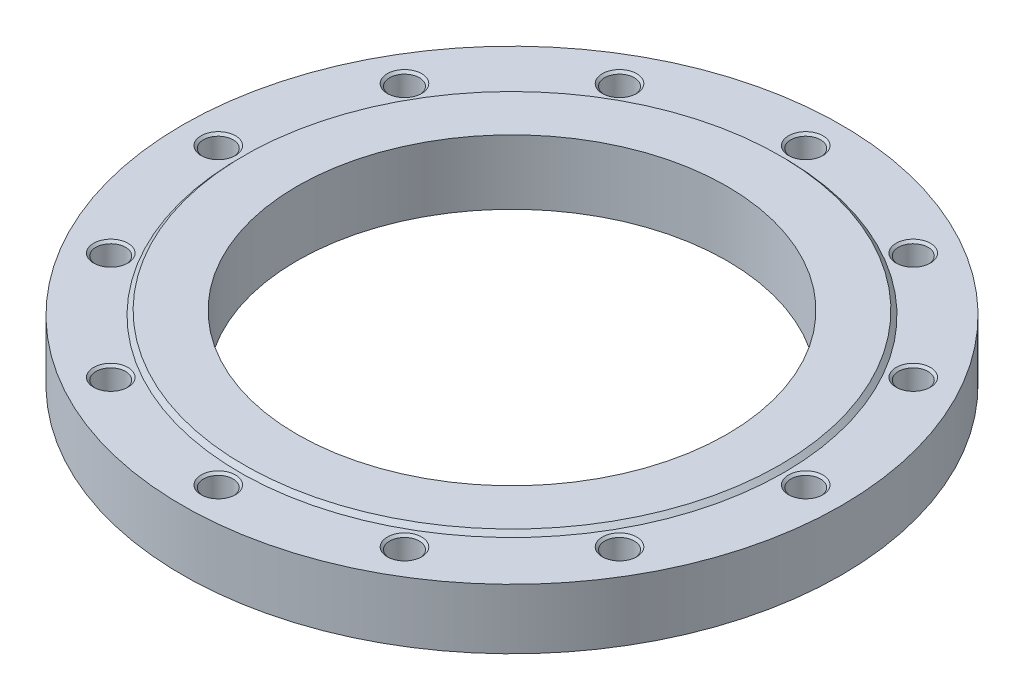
ISO-10303-21;
HEADER;
FILE_DESCRIPTION(('STEP AP214'),'2;1');
FILE_NAME('part.step','',(''),(''),'','','');
FILE_SCHEMA(('AUTOMOTIVE_DESIGN { 1 0 10303 214 1 1 1 1 }'));
ENDSEC;
DATA;
#1=APPLICATION_CONTEXT('core data for automotive mechanical design processes');
#2=APPLICATION_PROTOCOL_DEFINITION('international standard','automotive_design',2000,#1);
#3=PRODUCT_CONTEXT('',#1,'mechanical');
#4=PRODUCT('Part','Part','',(#3));
#5=PRODUCT_RELATED_PRODUCT_CATEGORY('part','',(#4));
#6=PRODUCT_DEFINITION_FORMATION('','',#4);
#7=PRODUCT_DEFINITION_CONTEXT('part definition',#1,'design');
#8=PRODUCT_DEFINITION('design','',#6,#7);
#9=PRODUCT_DEFINITION_SHAPE('','',#8);
#10=(LENGTH_UNIT() NAMED_UNIT(*) SI_UNIT(.MILLI.,.METRE.));
#11=(NAMED_UNIT(*) PLANE_ANGLE_UNIT() SI_UNIT($,.RADIAN.));
#12=(NAMED_UNIT(*) SI_UNIT($,.STERADIAN.) SOLID_ANGLE_UNIT());
#13=UNCERTAINTY_MEASURE_WITH_UNIT(LENGTH_MEASURE(1.E-05),#10,'distance_accuracy_value','');
#14=(GEOMETRIC_REPRESENTATION_CONTEXT(3) GLOBAL_UNCERTAINTY_ASSIGNED_CONTEXT((#13)) GLOBAL_UNIT_ASSIGNED_CONTEXT((#10,
#11,#12)) REPRESENTATION_CONTEXT('',''));
#15=CARTESIAN_POINT('',(0.,0.,0.));
#16=DIRECTION('',(0.,0.,1.));
#17=DIRECTION('',(1.,0.,0.));
#18=AXIS2_PLACEMENT_3D('',#15,#16,#17);
#19=CARTESIAN_POINT('',(0.,21.,0.));
#20=DIRECTION('',(0.,-1.,0.));
#21=DIRECTION('',(1.,0.,0.));
#22=AXIS2_PLACEMENT_3D('',#19,#20,#21);
#23=CYLINDRICAL_SURFACE('',#22,230.);
#24=CARTESIAN_POINT('',(0.,0.,0.));
#25=DIRECTION('',(0.,1.,0.));
#26=DIRECTION('',(1.,0.,0.));
#27=AXIS2_PLACEMENT_3D('',#24,#25,#26);
#28=CIRCLE('',#27,230.);
#29=CARTESIAN_POINT('',(230.,0.,0.));
#30=VERTEX_POINT('',#29);
#31=EDGE_CURVE('E9',#30,#30,#28,.T.);
#32=ORIENTED_EDGE('',*,*,#31,.T.);
#33=EDGE_LOOP('',(#32));
#34=FACE_BOUND('',#33,.T.);
#35=CARTESIAN_POINT('',(0.,42.,0.));
#36=DIRECTION('',(0.,1.,0.));
#37=DIRECTION('',(1.,0.,0.));
#38=AXIS2_PLACEMENT_3D('',#35,#36,#37);
#39=CIRCLE('',#38,230.);
#40=CARTESIAN_POINT('',(230.,42.,0.));
#41=VERTEX_POINT('',#40);
#42=EDGE_CURVE('E177',#41,#41,#39,.T.);
#43=ORIENTED_EDGE('',*,*,#42,.F.);
#44=EDGE_LOOP('',(#43));
#45=FACE_BOUND('',#44,.T.);
#46=ADVANCED_FACE('F15',(#34,#45),#23,.T.);
#47=CARTESIAN_POINT('',(190.,0.,0.));
#48=DIRECTION('',(0.,-1.,0.));
#49=DIRECTION('',(-1.,0.,0.));
#50=AXIS2_PLACEMENT_3D('',#47,#48,#49);
#51=PLANE('',#50);
#52=CARTESIAN_POINT('',(0.,0.,0.));
#53=DIRECTION('',(0.,1.,0.));
#54=DIRECTION('',(1.,0.,0.));
#55=AXIS2_PLACEMENT_3D('',#52,#53,#54);
#56=CIRCLE('',#55,150.);
#57=CARTESIAN_POINT('',(150.,0.,0.));
#58=VERTEX_POINT('',#57);
#59=EDGE_CURVE('E24',#58,#58,#56,.T.);
#60=ORIENTED_EDGE('',*,*,#59,.T.);
#61=EDGE_LOOP('',(#60));
#62=FACE_BOUND('',#61,.T.);
#63=ORIENTED_EDGE('',*,*,#31,.F.);
#64=EDGE_LOOP('',(#63));
#65=FACE_BOUND('',#64,.T.);
#66=ADVANCED_FACE('F419',(#62,#65),#51,.T.);
#67=CARTESIAN_POINT('',(0.,22.5,0.));
#68=DIRECTION('',(0.,-1.,0.));
#69=DIRECTION('',(1.,0.,0.));
#70=AXIS2_PLACEMENT_3D('',#67,#68,#69);
#71=CYLINDRICAL_SURFACE('',#70,150.);
#72=CARTESIAN_POINT('',(0.,45.,0.));
#73=DIRECTION('',(0.,1.,0.));
#74=DIRECTION('',(1.,0.,0.));
#75=AXIS2_PLACEMENT_3D('',#72,#73,#74);
#76=CIRCLE('',#75,150.);
#77=CARTESIAN_POINT('',(150.,45.,0.));
#78=VERTEX_POINT('',#77);
#79=EDGE_CURVE('E18',#78,#78,#76,.T.);
#80=ORIENTED_EDGE('',*,*,#79,.T.);
#81=EDGE_LOOP('',(#80));
#82=FACE_BOUND('',#81,.T.);
#83=ORIENTED_EDGE('',*,*,#59,.F.);
#84=EDGE_LOOP('',(#83));
#85=FACE_BOUND('',#84,.T.);
#86=ADVANCED_FACE('F423',(#82,#85),#71,.F.);
#87=CARTESIAN_POINT('',(168.5,45.,0.));
#88=DIRECTION('',(0.,1.,0.));
#89=DIRECTION('',(1.,0.,0.));
#90=AXIS2_PLACEMENT_3D('',#87,#88,#89);
#91=PLANE('',#90);
#92=CARTESIAN_POINT('',(0.,45.,0.));
#93=DIRECTION('',(0.,1.,0.));
#94=DIRECTION('',(1.,0.,0.));
#95=AXIS2_PLACEMENT_3D('',#92,#93,#94);
#96=CIRCLE('',#95,187.);
#97=CARTESIAN_POINT('',(187.,45.,0.));
#98=VERTEX_POINT('',#97);
#99=EDGE_CURVE('E382',#98,#98,#96,.T.);
#100=ORIENTED_EDGE('',*,*,#99,.T.);
#101=EDGE_LOOP('',(#100));
#102=FACE_BOUND('',#101,.T.);
#103=ORIENTED_EDGE('',*,*,#79,.F.);
#104=EDGE_LOOP('',(#103));
#105=FACE_BOUND('',#104,.T.);
#106=ADVANCED_FACE('F430',(#102,#105),#91,.T.);
#107=CARTESIAN_POINT('',(0.,43.5,0.));
#108=DIRECTION('',(0.,-1.,0.));
#109=DIRECTION('',(1.,0.,0.));
#110=AXIS2_PLACEMENT_3D('',#107,#108,#109);
#111=CONICAL_SURFACE('',#110,188.5,0.785398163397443);
#112=CARTESIAN_POINT('',(0.,42.,0.));
#113=DIRECTION('',(0.,1.,0.));
#114=DIRECTION('',(1.,0.,0.));
#115=AXIS2_PLACEMENT_3D('',#112,#113,#114);
#116=CIRCLE('',#115,190.);
#117=CARTESIAN_POINT('',(190.,42.,0.));
#118=VERTEX_POINT('',#117);
#119=EDGE_CURVE('E182',#118,#118,#116,.T.);
#120=ORIENTED_EDGE('',*,*,#119,.T.);
#121=EDGE_LOOP('',(#120));
#122=FACE_BOUND('',#121,.T.);
#123=ORIENTED_EDGE('',*,*,#99,.F.);
#124=EDGE_LOOP('',(#123));
#125=FACE_BOUND('',#124,.T.);
#126=ADVANCED_FACE('F415',(#122,#125),#111,.T.);
#127=CARTESIAN_POINT('',(210.,42.,0.));
#128=DIRECTION('',(0.,1.,0.));
#129=DIRECTION('',(1.,0.,0.));
#130=AXIS2_PLACEMENT_3D('',#127,#128,#129);
#131=PLANE('',#130);
#132=ORIENTED_EDGE('',*,*,#42,.T.);
#133=EDGE_LOOP('',(#132));
#134=FACE_BOUND('',#133,.T.);
#135=ORIENTED_EDGE('',*,*,#119,.F.);
#136=EDGE_LOOP('',(#135));
#137=FACE_BOUND('',#136,.T.);
#138=CARTESIAN_POINT('',(205.,42.,0.));
#139=DIRECTION('',(0.,-1.,0.));
#140=DIRECTION('',(1.,0.,0.));
#141=AXIS2_PLACEMENT_3D('',#138,#139,#140);
#142=CIRCLE('',#141,12.);
#143=CARTESIAN_POINT('',(217.,42.,0.));
#144=VERTEX_POINT('',#143);
#145=EDGE_CURVE('E373',#144,#144,#142,.T.);
#146=ORIENTED_EDGE('',*,*,#145,.T.);
#147=EDGE_LOOP('',(#146));
#148=FACE_BOUND('',#147,.T.);
#149=CARTESIAN_POINT('',(177.53520777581,42.,-102.5));
#150=DIRECTION('',(0.,-1.,0.));
#151=DIRECTION('',(0.866025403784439,0.,-0.5));
#152=AXIS2_PLACEMENT_3D('',#149,#150,#151);
#153=CIRCLE('',#152,12.);
#154=CARTESIAN_POINT('',(187.927512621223,42.,-108.5));
#155=VERTEX_POINT('',#154);
#156=EDGE_CURVE('E244',#155,#155,#153,.T.);
#157=ORIENTED_EDGE('',*,*,#156,.T.);
#158=EDGE_LOOP('',(#157));
#159=FACE_BOUND('',#158,.T.);
#160=CARTESIAN_POINT('',(102.5,42.,-177.53520777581));
#161=DIRECTION('',(0.,-1.,0.));
#162=DIRECTION('',(0.5,0.,-0.866025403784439));
#163=AXIS2_PLACEMENT_3D('',#160,#161,#162);
#164=CIRCLE('',#163,12.);
#165=CARTESIAN_POINT('',(108.5,42.,-187.927512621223));
#166=VERTEX_POINT('',#165);
#167=EDGE_CURVE('E267',#166,#166,#164,.T.);
#168=ORIENTED_EDGE('',*,*,#167,.T.);
#169=EDGE_LOOP('',(#168));
#170=FACE_BOUND('',#169,.T.);
#171=CARTESIAN_POINT('',(0.,42.,-205.));
#172=DIRECTION('',(0.,-1.,0.));
#173=DIRECTION('',(0.,0.,-1.));
#174=AXIS2_PLACEMENT_3D('',#171,#172,#173);
#175=CIRCLE('',#174,12.);
#176=CARTESIAN_POINT('',(0.,42.,-217.));
#177=VERTEX_POINT('',#176);
#178=EDGE_CURVE('E369',#177,#177,#175,.T.);
#179=ORIENTED_EDGE('',*,*,#178,.T.);
#180=EDGE_LOOP('',(#179));
#181=FACE_BOUND('',#180,.T.);
#182=CARTESIAN_POINT('',(-102.5,42.,-177.53520777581));
#183=DIRECTION('',(0.,-1.,0.));
#184=DIRECTION('',(-0.5,0.,-0.866025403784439));
#185=AXIS2_PLACEMENT_3D('',#182,#183,#184);
#186=CIRCLE('',#185,12.);
#187=CARTESIAN_POINT('',(-108.5,42.,-187.927512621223));
#188=VERTEX_POINT('',#187);
#189=EDGE_CURVE('E353',#188,#188,#186,.T.);
#190=ORIENTED_EDGE('',*,*,#189,.T.);
#191=EDGE_LOOP('',(#190));
#192=FACE_BOUND('',#191,.T.);
#193=CARTESIAN_POINT('',(-177.53520777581,42.,-102.5));
#194=DIRECTION('',(0.,-1.,0.));
#195=DIRECTION('',(-0.866025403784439,0.,-0.5));
#196=AXIS2_PLACEMENT_3D('',#193,#194,#195);
#197=CIRCLE('',#196,12.);
#198=CARTESIAN_POINT('',(-187.927512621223,42.,-108.5));
#199=VERTEX_POINT('',#198);
#200=EDGE_CURVE('E339',#199,#199,#197,.T.);
#201=ORIENTED_EDGE('',*,*,#200,.T.);
#202=EDGE_LOOP('',(#201));
#203=FACE_BOUND('',#202,.T.);
#204=CARTESIAN_POINT('',(-205.,42.,0.));
#205=DIRECTION('',(0.,-1.,0.));
#206=DIRECTION('',(-1.,0.,0.));
#207=AXIS2_PLACEMENT_3D('',#204,#205,#206);
#208=CIRCLE('',#207,12.);
#209=CARTESIAN_POINT('',(-217.,42.,0.));
#210=VERTEX_POINT('',#209);
#211=EDGE_CURVE('E327',#210,#210,#208,.T.);
#212=ORIENTED_EDGE('',*,*,#211,.T.);
#213=EDGE_LOOP('',(#212));
#214=FACE_BOUND('',#213,.T.);
#215=CARTESIAN_POINT('',(-177.53520777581,42.,102.5));
#216=DIRECTION('',(0.,-1.,0.));
#217=DIRECTION('',(-0.866025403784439,0.,0.5));
#218=AXIS2_PLACEMENT_3D('',#215,#216,#217);
#219=CIRCLE('',#218,12.);
#220=CARTESIAN_POINT('',(-187.927512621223,42.,108.5));
#221=VERTEX_POINT('',#220);
#222=EDGE_CURVE('E222',#221,#221,#219,.T.);
#223=ORIENTED_EDGE('',*,*,#222,.T.);
#224=EDGE_LOOP('',(#223));
#225=FACE_BOUND('',#224,.T.);
#226=CARTESIAN_POINT('',(-102.5,42.,177.53520777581));
#227=DIRECTION('',(0.,-1.,0.));
#228=DIRECTION('',(-0.5,0.,0.866025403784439));
#229=AXIS2_PLACEMENT_3D('',#226,#227,#228);
#230=CIRCLE('',#229,12.);
#231=CARTESIAN_POINT('',(-108.5,42.,187.927512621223));
#232=VERTEX_POINT('',#231);
#233=EDGE_CURVE('E309',#232,#232,#230,.T.);
#234=ORIENTED_EDGE('',*,*,#233,.T.);
#235=EDGE_LOOP('',(#234));
#236=FACE_BOUND('',#235,.T.);
#237=CARTESIAN_POINT('',(0.,42.,205.));
#238=DIRECTION('',(0.,-1.,0.));
#239=DIRECTION('',(0.,0.,1.));
#240=AXIS2_PLACEMENT_3D('',#237,#238,#239);
#241=CIRCLE('',#240,12.);
#242=CARTESIAN_POINT('',(0.,42.,217.));
#243=VERTEX_POINT('',#242);
#244=EDGE_CURVE('E251',#243,#243,#241,.T.);
#245=ORIENTED_EDGE('',*,*,#244,.T.);
#246=EDGE_LOOP('',(#245));
#247=FACE_BOUND('',#246,.T.);
#248=CARTESIAN_POINT('',(102.5,42.,177.53520777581));
#249=DIRECTION('',(0.,-1.,0.));
#250=DIRECTION('',(0.5,0.,0.866025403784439));
#251=AXIS2_PLACEMENT_3D('',#248,#249,#250);
#252=CIRCLE('',#251,12.);
#253=CARTESIAN_POINT('',(108.5,42.,187.927512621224));
#254=VERTEX_POINT('',#253);
#255=EDGE_CURVE('E234',#254,#254,#252,.T.);
#256=ORIENTED_EDGE('',*,*,#255,.T.);
#257=EDGE_LOOP('',(#256));
#258=FACE_BOUND('',#257,.T.);
#259=CARTESIAN_POINT('',(177.53520777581,42.,102.5));
#260=DIRECTION('',(0.,-1.,0.));
#261=DIRECTION('',(0.866025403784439,0.,0.5));
#262=AXIS2_PLACEMENT_3D('',#259,#260,#261);
#263=CIRCLE('',#262,12.);
#264=CARTESIAN_POINT('',(187.927512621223,42.,108.5));
#265=VERTEX_POINT('',#264);
#266=EDGE_CURVE('E243',#265,#265,#263,.T.);
#267=ORIENTED_EDGE('',*,*,#266,.T.);
#268=EDGE_LOOP('',(#267));
#269=FACE_BOUND('',#268,.T.);
#270=ADVANCED_FACE('F223',(#134,#137,#148,#159,#170,#181,#192,#203,#214,#225,#236,#247,#258,
#269),#131,.T.);
#271=CARTESIAN_POINT('',(205.,6.00463463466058,0.));
#272=DIRECTION('',(0.,1.,0.));
#273=DIRECTION('',(1.,0.,0.));
#274=AXIS2_PLACEMENT_3D('',#271,#272,#273);
#275=CONICAL_SURFACE('',#274,5.188125,1.0471975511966);
#276=CARTESIAN_POINT('',(205.,9.,0.));
#277=DIRECTION('',(0.,-1.,0.));
#278=DIRECTION('',(1.,0.,0.));
#279=AXIS2_PLACEMENT_3D('',#276,#277,#278);
#280=CIRCLE('',#279,10.37625);
#281=CARTESIAN_POINT('',(215.37625,9.,0.));
#282=VERTEX_POINT('',#281);
#283=EDGE_CURVE('E292',#282,#282,#280,.T.);
#284=ORIENTED_EDGE('',*,*,#283,.F.);
#285=EDGE_LOOP('',(#284));
#286=FACE_BOUND('',#285,.T.);
#287=CARTESIAN_POINT('',(205.,3.00926926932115,0.));
#288=VERTEX_POINT('',#287);
#289=VERTEX_LOOP('',#288);
#290=FACE_BOUND('',#289,.T.);
#291=ADVANCED_FACE('F403',(#286,#290),#275,.F.);
#292=CARTESIAN_POINT('',(205.,12.688125,0.));
#293=DIRECTION('',(0.,1.,0.));
#294=DIRECTION('',(1.,0.,0.));
#295=AXIS2_PLACEMENT_3D('',#292,#293,#294);
#296=CYLINDRICAL_SURFACE('',#295,10.37625);
#297=CARTESIAN_POINT('',(205.,16.37625,0.));
#298=DIRECTION('',(0.,-1.,0.));
#299=DIRECTION('',(1.,0.,0.));
#300=AXIS2_PLACEMENT_3D('',#297,#298,#299);
#301=CIRCLE('',#300,10.37625);
#302=CARTESIAN_POINT('',(215.37625,16.37625,0.));
#303=VERTEX_POINT('',#302);
#304=EDGE_CURVE('E290',#303,#303,#301,.T.);
#305=ORIENTED_EDGE('',*,*,#304,.F.);
#306=EDGE_LOOP('',(#305));
#307=FACE_BOUND('',#306,.T.);
#308=ORIENTED_EDGE('',*,*,#283,.T.);
#309=EDGE_LOOP('',(#308));
#310=FACE_BOUND('',#309,.T.);
#311=ADVANCED_FACE('F401',(#307,#310),#296,.F.);
#312=CARTESIAN_POINT('',(205.,17.188125,0.));
#313=DIRECTION('',(0.,1.,0.));
#314=DIRECTION('',(1.,0.,0.));
#315=AXIS2_PLACEMENT_3D('',#312,#313,#314);
#316=CONICAL_SURFACE('',#315,11.188125,0.785398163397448);
#317=CARTESIAN_POINT('',(205.,18.,0.));
#318=DIRECTION('',(0.,-1.,0.));
#319=DIRECTION('',(1.,0.,0.));
#320=AXIS2_PLACEMENT_3D('',#317,#318,#319);
#321=CIRCLE('',#320,12.);
#322=CARTESIAN_POINT('',(217.,18.,0.));
#323=VERTEX_POINT('',#322);
#324=EDGE_CURVE('E293',#323,#323,#321,.T.);
#325=ORIENTED_EDGE('',*,*,#324,.F.);
#326=EDGE_LOOP('',(#325));
#327=FACE_BOUND('',#326,.T.);
#328=ORIENTED_EDGE('',*,*,#304,.T.);
#329=EDGE_LOOP('',(#328));
#330=FACE_BOUND('',#329,.T.);
#331=ADVANCED_FACE('F412',(#327,#330),#316,.F.);
#332=CARTESIAN_POINT('',(216.188125,18.,0.));
#333=DIRECTION('',(0.,1.,0.));
#334=DIRECTION('',(-1.,0.,0.));
#335=AXIS2_PLACEMENT_3D('',#332,#333,#334);
#336=PLANE('',#335);
#337=CARTESIAN_POINT('',(205.,18.,0.));
#338=DIRECTION('',(0.,-1.,0.));
#339=DIRECTION('',(1.,0.,0.));
#340=AXIS2_PLACEMENT_3D('',#337,#338,#339);
#341=CIRCLE('',#340,10.37625);
#342=CARTESIAN_POINT('',(215.37625,18.,0.));
#343=VERTEX_POINT('',#342);
#344=EDGE_CURVE('E371',#343,#343,#341,.T.);
#345=ORIENTED_EDGE('',*,*,#344,.F.);
#346=EDGE_LOOP('',(#345));
#347=FACE_BOUND('',#346,.T.);
#348=ORIENTED_EDGE('',*,*,#324,.T.);
#349=EDGE_LOOP('',(#348));
#350=FACE_BOUND('',#349,.T.);
#351=ADVANCED_FACE('F472',(#347,#350),#336,.F.);
#352=CARTESIAN_POINT('',(205.,29.188125,0.));
#353=DIRECTION('',(0.,1.,0.));
#354=DIRECTION('',(1.,0.,0.));
#355=AXIS2_PLACEMENT_3D('',#352,#353,#354);
#356=CYLINDRICAL_SURFACE('',#355,10.37625);
#357=CARTESIAN_POINT('',(205.,40.37625,0.));
#358=DIRECTION('',(0.,-1.,0.));
#359=DIRECTION('',(1.,0.,0.));
#360=AXIS2_PLACEMENT_3D('',#357,#358,#359);
#361=CIRCLE('',#360,10.37625);
#362=CARTESIAN_POINT('',(215.37625,40.37625,0.));
#363=VERTEX_POINT('',#362);
#364=EDGE_CURVE('E283',#363,#363,#361,.T.);
#365=ORIENTED_EDGE('',*,*,#364,.F.);
#366=EDGE_LOOP('',(#365));
#367=FACE_BOUND('',#366,.T.);
#368=ORIENTED_EDGE('',*,*,#344,.T.);
#369=EDGE_LOOP('',(#368));
#370=FACE_BOUND('',#369,.T.);
#371=ADVANCED_FACE('F527',(#367,#370),#356,.F.);
#372=CARTESIAN_POINT('',(205.,41.188125,0.));
#373=DIRECTION('',(0.,1.,0.));
#374=DIRECTION('',(1.,0.,0.));
#375=AXIS2_PLACEMENT_3D('',#372,#373,#374);
#376=CONICAL_SURFACE('',#375,11.188125,0.785398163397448);
#377=ORIENTED_EDGE('',*,*,#145,.F.);
#378=EDGE_LOOP('',(#377));
#379=FACE_BOUND('',#378,.T.);
#380=ORIENTED_EDGE('',*,*,#364,.T.);
#381=EDGE_LOOP('',(#380));
#382=FACE_BOUND('',#381,.T.);
#383=ADVANCED_FACE('F524',(#379,#382),#376,.F.);
#384=CARTESIAN_POINT('',(177.53520777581,6.00463463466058,-102.5));
#385=DIRECTION('',(0.,1.,0.));
#386=DIRECTION('',(0.866025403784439,0.,-0.5));
#387=AXIS2_PLACEMENT_3D('',#384,#385,#386);
#388=CONICAL_SURFACE('',#387,5.188125,1.0471975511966);
#389=CARTESIAN_POINT('',(177.53520777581,9.,-102.5));
#390=DIRECTION('',(0.,-1.,0.));
#391=DIRECTION('',(0.866025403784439,0.,-0.5));
#392=AXIS2_PLACEMENT_3D('',#389,#390,#391);
#393=CIRCLE('',#392,10.37625);
#394=CARTESIAN_POINT('',(186.521303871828,9.,-107.688125));
#395=VERTEX_POINT('',#394);
#396=EDGE_CURVE('E281',#395,#395,#393,.T.);
#397=ORIENTED_EDGE('',*,*,#396,.F.);
#398=EDGE_LOOP('',(#397));
#399=FACE_BOUND('',#398,.T.);
#400=CARTESIAN_POINT('',(177.53520777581,3.00926926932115,-102.5));
#401=VERTEX_POINT('',#400);
#402=VERTEX_LOOP('',#401);
#403=FACE_BOUND('',#402,.T.);
#404=ADVANCED_FACE('F522',(#399,#403),#388,.F.);
#405=CARTESIAN_POINT('',(177.53520777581,12.688125,-102.5));
#406=DIRECTION('',(0.,1.,0.));
#407=DIRECTION('',(0.866025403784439,0.,-0.5));
#408=AXIS2_PLACEMENT_3D('',#405,#406,#407);
#409=CYLINDRICAL_SURFACE('',#408,10.37625);
#410=CARTESIAN_POINT('',(177.53520777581,16.37625,-102.5));
#411=DIRECTION('',(0.,-1.,0.));
#412=DIRECTION('',(0.866025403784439,0.,-0.5));
#413=AXIS2_PLACEMENT_3D('',#410,#411,#412);
#414=CIRCLE('',#413,10.37625);
#415=CARTESIAN_POINT('',(186.521303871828,16.37625,-107.688125));
#416=VERTEX_POINT('',#415);
#417=EDGE_CURVE('E284',#416,#416,#414,.T.);
#418=ORIENTED_EDGE('',*,*,#417,.F.);
#419=EDGE_LOOP('',(#418));
#420=FACE_BOUND('',#419,.T.);
#421=ORIENTED_EDGE('',*,*,#396,.T.);
#422=EDGE_LOOP('',(#421));
#423=FACE_BOUND('',#422,.T.);
#424=ADVANCED_FACE('F455',(#420,#423),#409,.F.);
#425=CARTESIAN_POINT('',(177.53520777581,17.188125,-102.5));
#426=DIRECTION('',(0.,1.,0.));
#427=DIRECTION('',(0.866025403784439,0.,-0.5));
#428=AXIS2_PLACEMENT_3D('',#425,#426,#427);
#429=CONICAL_SURFACE('',#428,11.188125,0.785398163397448);
#430=CARTESIAN_POINT('',(177.53520777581,18.,-102.5));
#431=DIRECTION('',(0.,-1.,0.));
#432=DIRECTION('',(0.866025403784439,0.,-0.5));
#433=AXIS2_PLACEMENT_3D('',#430,#431,#432);
#434=CIRCLE('',#433,12.);
#435=CARTESIAN_POINT('',(187.927512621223,18.,-108.5));
#436=VERTEX_POINT('',#435);
#437=EDGE_CURVE('E356',#436,#436,#434,.T.);
#438=ORIENTED_EDGE('',*,*,#437,.F.);
#439=EDGE_LOOP('',(#438));
#440=FACE_BOUND('',#439,.T.);
#441=ORIENTED_EDGE('',*,*,#417,.T.);
#442=EDGE_LOOP('',(#441));
#443=FACE_BOUND('',#442,.T.);
#444=ADVANCED_FACE('F451',(#440,#443),#429,.F.);
#445=CARTESIAN_POINT('',(187.224408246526,18.,-108.0940625));
#446=DIRECTION('',(0.,1.,0.));
#447=DIRECTION('',(-0.866025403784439,0.,0.5));
#448=AXIS2_PLACEMENT_3D('',#445,#446,#447);
#449=PLANE('',#448);
#450=CARTESIAN_POINT('',(177.53520777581,18.,-102.5));
#451=DIRECTION('',(0.,-1.,0.));
#452=DIRECTION('',(0.866025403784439,0.,-0.5));
#453=AXIS2_PLACEMENT_3D('',#450,#451,#452);
#454=CIRCLE('',#453,10.37625);
#455=CARTESIAN_POINT('',(186.521303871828,18.,-107.688125));
#456=VERTEX_POINT('',#455);
#457=EDGE_CURVE('E246',#456,#456,#454,.T.);
#458=ORIENTED_EDGE('',*,*,#457,.F.);
#459=EDGE_LOOP('',(#458));
#460=FACE_BOUND('',#459,.T.);
#461=ORIENTED_EDGE('',*,*,#437,.T.);
#462=EDGE_LOOP('',(#461));
#463=FACE_BOUND('',#462,.T.);
#464=ADVANCED_FACE('F454',(#460,#463),#449,.F.);
#465=CARTESIAN_POINT('',(177.53520777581,29.188125,-102.5));
#466=DIRECTION('',(0.,1.,0.));
#467=DIRECTION('',(0.866025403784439,0.,-0.5));
#468=AXIS2_PLACEMENT_3D('',#465,#466,#467);
#469=CYLINDRICAL_SURFACE('',#468,10.37625);
#470=CARTESIAN_POINT('',(177.53520777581,40.37625,-102.5));
#471=DIRECTION('',(0.,-1.,0.));
#472=DIRECTION('',(0.866025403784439,0.,-0.5));
#473=AXIS2_PLACEMENT_3D('',#470,#471,#472);
#474=CIRCLE('',#473,10.37625);
#475=CARTESIAN_POINT('',(186.521303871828,40.37625,-107.688125));
#476=VERTEX_POINT('',#475);
#477=EDGE_CURVE('E247',#476,#476,#474,.T.);
#478=ORIENTED_EDGE('',*,*,#477,.F.);
#479=EDGE_LOOP('',(#478));
#480=FACE_BOUND('',#479,.T.);
#481=ORIENTED_EDGE('',*,*,#457,.T.);
#482=EDGE_LOOP('',(#481));
#483=FACE_BOUND('',#482,.T.);
#484=ADVANCED_FACE('F512',(#480,#483),#469,.F.);
#485=CARTESIAN_POINT('',(177.53520777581,41.188125,-102.5));
#486=DIRECTION('',(0.,1.,0.));
#487=DIRECTION('',(0.866025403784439,0.,-0.5));
#488=AXIS2_PLACEMENT_3D('',#485,#486,#487);
#489=CONICAL_SURFACE('',#488,11.188125,0.785398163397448);
#490=ORIENTED_EDGE('',*,*,#156,.F.);
#491=EDGE_LOOP('',(#490));
#492=FACE_BOUND('',#491,.T.);
#493=ORIENTED_EDGE('',*,*,#477,.T.);
#494=EDGE_LOOP('',(#493));
#495=FACE_BOUND('',#494,.T.);
#496=ADVANCED_FACE('F508',(#492,#495),#489,.F.);
#497=CARTESIAN_POINT('',(102.5,6.00463463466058,-177.53520777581));
#498=DIRECTION('',(0.,1.,0.));
#499=DIRECTION('',(0.5,0.,-0.866025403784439));
#500=AXIS2_PLACEMENT_3D('',#497,#498,#499);
#501=CONICAL_SURFACE('',#500,5.188125,1.0471975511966);
#502=CARTESIAN_POINT('',(102.5,9.,-177.53520777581));
#503=DIRECTION('',(0.,-1.,0.));
#504=DIRECTION('',(0.5,0.,-0.866025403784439));
#505=AXIS2_PLACEMENT_3D('',#502,#503,#504);
#506=CIRCLE('',#505,10.37625);
#507=CARTESIAN_POINT('',(107.688125,9.,-186.521303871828));
#508=VERTEX_POINT('',#507);
#509=EDGE_CURVE('E389',#508,#508,#506,.T.);
#510=ORIENTED_EDGE('',*,*,#509,.F.);
#511=EDGE_LOOP('',(#510));
#512=FACE_BOUND('',#511,.T.);
#513=CARTESIAN_POINT('',(102.5,3.00926926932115,-177.53520777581));
#514=VERTEX_POINT('',#513);
#515=VERTEX_LOOP('',#514);
#516=FACE_BOUND('',#515,.T.);
#517=ADVANCED_FACE('F504',(#512,#516),#501,.F.);
#518=CARTESIAN_POINT('',(102.5,12.688125,-177.53520777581));
#519=DIRECTION('',(0.,1.,0.));
#520=DIRECTION('',(0.5,0.,-0.866025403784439));
#521=AXIS2_PLACEMENT_3D('',#518,#519,#520);
#522=CYLINDRICAL_SURFACE('',#521,10.37625);
#523=CARTESIAN_POINT('',(102.5,16.37625,-177.53520777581));
#524=DIRECTION('',(0.,-1.,0.));
#525=DIRECTION('',(0.5,0.,-0.866025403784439));
#526=AXIS2_PLACEMENT_3D('',#523,#524,#525);
#527=CIRCLE('',#526,10.37625);
#528=CARTESIAN_POINT('',(107.688125,16.37625,-186.521303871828));
#529=VERTEX_POINT('',#528);
#530=EDGE_CURVE('E386',#529,#529,#527,.T.);
#531=ORIENTED_EDGE('',*,*,#530,.F.);
#532=EDGE_LOOP('',(#531));
#533=FACE_BOUND('',#532,.T.);
#534=ORIENTED_EDGE('',*,*,#509,.T.);
#535=EDGE_LOOP('',(#534));
#536=FACE_BOUND('',#535,.T.);
#537=ADVANCED_FACE('F500',(#533,#536),#522,.F.);
#538=CARTESIAN_POINT('',(102.5,17.188125,-177.53520777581));
#539=DIRECTION('',(0.,1.,0.));
#540=DIRECTION('',(0.5,0.,-0.866025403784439));
#541=AXIS2_PLACEMENT_3D('',#538,#539,#540);
#542=CONICAL_SURFACE('',#541,11.188125,0.785398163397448);
#543=CARTESIAN_POINT('',(102.5,18.,-177.53520777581));
#544=DIRECTION('',(0.,-1.,0.));
#545=DIRECTION('',(0.5,0.,-0.866025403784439));
#546=AXIS2_PLACEMENT_3D('',#543,#544,#545);
#547=CIRCLE('',#546,12.);
#548=CARTESIAN_POINT('',(108.5,18.,-187.927512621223));
#549=VERTEX_POINT('',#548);
#550=EDGE_CURVE('E384',#549,#549,#547,.T.);
#551=ORIENTED_EDGE('',*,*,#550,.F.);
#552=EDGE_LOOP('',(#551));
#553=FACE_BOUND('',#552,.T.);
#554=ORIENTED_EDGE('',*,*,#530,.T.);
#555=EDGE_LOOP('',(#554));
#556=FACE_BOUND('',#555,.T.);
#557=ADVANCED_FACE('F503',(#553,#556),#542,.F.);
#558=CARTESIAN_POINT('',(108.0940625,18.,-187.224408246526));
#559=DIRECTION('',(0.,1.,0.));
#560=DIRECTION('',(-0.5,0.,0.866025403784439));
#561=AXIS2_PLACEMENT_3D('',#558,#559,#560);
#562=PLANE('',#561);
#563=CARTESIAN_POINT('',(102.5,18.,-177.53520777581));
#564=DIRECTION('',(0.,-1.,0.));
#565=DIRECTION('',(0.5,0.,-0.866025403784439));
#566=AXIS2_PLACEMENT_3D('',#563,#564,#565);
#567=CIRCLE('',#566,10.37625);
#568=CARTESIAN_POINT('',(107.688125,18.,-186.521303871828));
#569=VERTEX_POINT('',#568);
#570=EDGE_CURVE('E269',#569,#569,#567,.T.);
#571=ORIENTED_EDGE('',*,*,#570,.F.);
#572=EDGE_LOOP('',(#571));
#573=FACE_BOUND('',#572,.T.);
#574=ORIENTED_EDGE('',*,*,#550,.T.);
#575=EDGE_LOOP('',(#574));
#576=FACE_BOUND('',#575,.T.);
#577=ADVANCED_FACE('F692',(#573,#576),#562,.F.);
#578=CARTESIAN_POINT('',(102.5,29.188125,-177.53520777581));
#579=DIRECTION('',(0.,1.,0.));
#580=DIRECTION('',(0.5,0.,-0.866025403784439));
#581=AXIS2_PLACEMENT_3D('',#578,#579,#580);
#582=CYLINDRICAL_SURFACE('',#581,10.37625);
#583=CARTESIAN_POINT('',(102.5,40.37625,-177.53520777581));
#584=DIRECTION('',(0.,-1.,0.));
#585=DIRECTION('',(0.5,0.,-0.866025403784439));
#586=AXIS2_PLACEMENT_3D('',#583,#584,#585);
#587=CIRCLE('',#586,10.37625);
#588=CARTESIAN_POINT('',(107.688125,40.37625,-186.521303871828));
#589=VERTEX_POINT('',#588);
#590=EDGE_CURVE('E270',#589,#589,#587,.T.);
#591=ORIENTED_EDGE('',*,*,#590,.F.);
#592=EDGE_LOOP('',(#591));
#593=FACE_BOUND('',#592,.T.);
#594=ORIENTED_EDGE('',*,*,#570,.T.);
#595=EDGE_LOOP('',(#594));
#596=FACE_BOUND('',#595,.T.);
#597=ADVANCED_FACE('F498',(#593,#596),#582,.F.);
#598=CARTESIAN_POINT('',(102.5,41.188125,-177.53520777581));
#599=DIRECTION('',(0.,1.,0.));
#600=DIRECTION('',(0.5,0.,-0.866025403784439));
#601=AXIS2_PLACEMENT_3D('',#598,#599,#600);
#602=CONICAL_SURFACE('',#601,11.188125,0.785398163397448);
#603=ORIENTED_EDGE('',*,*,#167,.F.);
#604=EDGE_LOOP('',(#603));
#605=FACE_BOUND('',#604,.T.);
#606=ORIENTED_EDGE('',*,*,#590,.T.);
#607=EDGE_LOOP('',(#606));
#608=FACE_BOUND('',#607,.T.);
#609=ADVANCED_FACE('F494',(#605,#608),#602,.F.);
#610=CARTESIAN_POINT('',(0.,6.00463463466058,-205.));
#611=DIRECTION('',(0.,1.,0.));
#612=DIRECTION('',(0.,0.,-1.));
#613=AXIS2_PLACEMENT_3D('',#610,#611,#612);
#614=CONICAL_SURFACE('',#613,5.188125,1.0471975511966);
#615=CARTESIAN_POINT('',(0.,9.,-205.));
#616=DIRECTION('',(0.,-1.,0.));
#617=DIRECTION('',(0.,0.,-1.));
#618=AXIS2_PLACEMENT_3D('',#615,#616,#617);
#619=CIRCLE('',#618,10.37625);
#620=CARTESIAN_POINT('',(0.,9.,-215.37625));
#621=VERTEX_POINT('',#620);
#622=EDGE_CURVE('E377',#621,#621,#619,.T.);
#623=ORIENTED_EDGE('',*,*,#622,.F.);
#624=EDGE_LOOP('',(#623));
#625=FACE_BOUND('',#624,.T.);
#626=CARTESIAN_POINT('',(0.,3.00926926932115,-205.));
#627=VERTEX_POINT('',#626);
#628=VERTEX_LOOP('',#627);
#629=FACE_BOUND('',#628,.T.);
#630=ADVANCED_FACE('F490',(#625,#629),#614,.F.);
#631=CARTESIAN_POINT('',(0.,12.688125,-205.));
#632=DIRECTION('',(0.,1.,0.));
#633=DIRECTION('',(0.,0.,-1.));
#634=AXIS2_PLACEMENT_3D('',#631,#632,#633);
#635=CYLINDRICAL_SURFACE('',#634,10.37625);
#636=CARTESIAN_POINT('',(0.,16.37625,-205.));
#637=DIRECTION('',(0.,-1.,0.));
#638=DIRECTION('',(0.,0.,-1.));
#639=AXIS2_PLACEMENT_3D('',#636,#637,#638);
#640=CIRCLE('',#639,10.37625);
#641=CARTESIAN_POINT('',(0.,16.37625,-215.37625));
#642=VERTEX_POINT('',#641);
#643=EDGE_CURVE('E299',#642,#642,#640,.T.);
#644=ORIENTED_EDGE('',*,*,#643,.F.);
#645=EDGE_LOOP('',(#644));
#646=FACE_BOUND('',#645,.T.);
#647=ORIENTED_EDGE('',*,*,#622,.T.);
#648=EDGE_LOOP('',(#647));
#649=FACE_BOUND('',#648,.T.);
#650=ADVANCED_FACE('F486',(#646,#649),#635,.F.);
#651=CARTESIAN_POINT('',(0.,17.188125,-205.));
#652=DIRECTION('',(0.,1.,0.));
#653=DIRECTION('',(0.,0.,-1.));
#654=AXIS2_PLACEMENT_3D('',#651,#652,#653);
#655=CONICAL_SURFACE('',#654,11.188125,0.785398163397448);
#656=CARTESIAN_POINT('',(0.,18.,-205.));
#657=DIRECTION('',(0.,-1.,0.));
#658=DIRECTION('',(0.,0.,-1.));
#659=AXIS2_PLACEMENT_3D('',#656,#657,#658);
#660=CIRCLE('',#659,12.);
#661=CARTESIAN_POINT('',(0.,18.,-217.));
#662=VERTEX_POINT('',#661);
#663=EDGE_CURVE('E297',#662,#662,#660,.T.);
#664=ORIENTED_EDGE('',*,*,#663,.F.);
#665=EDGE_LOOP('',(#664));
#666=FACE_BOUND('',#665,.T.);
#667=ORIENTED_EDGE('',*,*,#643,.T.);
#668=EDGE_LOOP('',(#667));
#669=FACE_BOUND('',#668,.T.);
#670=ADVANCED_FACE('F482',(#666,#669),#655,.F.);
#671=CARTESIAN_POINT('',(0.,18.,-216.188125));
#672=DIRECTION('',(0.,1.,0.));
#673=DIRECTION('',(0.,0.,1.));
#674=AXIS2_PLACEMENT_3D('',#671,#672,#673);
#675=PLANE('',#674);
#676=CARTESIAN_POINT('',(0.,18.,-205.));
#677=DIRECTION('',(0.,-1.,0.));
#678=DIRECTION('',(0.,0.,-1.));
#679=AXIS2_PLACEMENT_3D('',#676,#677,#678);
#680=CIRCLE('',#679,10.37625);
#681=CARTESIAN_POINT('',(0.,18.,-215.37625));
#682=VERTEX_POINT('',#681);
#683=EDGE_CURVE('E300',#682,#682,#680,.T.);
#684=ORIENTED_EDGE('',*,*,#683,.F.);
#685=EDGE_LOOP('',(#684));
#686=FACE_BOUND('',#685,.T.);
#687=ORIENTED_EDGE('',*,*,#663,.T.);
#688=EDGE_LOOP('',(#687));
#689=FACE_BOUND('',#688,.T.);
#690=ADVANCED_FACE('F476',(#686,#689),#675,.F.);
#691=CARTESIAN_POINT('',(0.,29.188125,-205.));
#692=DIRECTION('',(0.,1.,0.));
#693=DIRECTION('',(0.,0.,-1.));
#694=AXIS2_PLACEMENT_3D('',#691,#692,#693);
#695=CYLINDRICAL_SURFACE('',#694,10.37625);
#696=CARTESIAN_POINT('',(0.,40.37625,-205.));
#697=DIRECTION('',(0.,-1.,0.));
#698=DIRECTION('',(0.,0.,-1.));
#699=AXIS2_PLACEMENT_3D('',#696,#697,#698);
#700=CIRCLE('',#699,10.37625);
#701=CARTESIAN_POINT('',(0.,40.37625,-215.37625));
#702=VERTEX_POINT('',#701);
#703=EDGE_CURVE('E367',#702,#702,#700,.T.);
#704=ORIENTED_EDGE('',*,*,#703,.F.);
#705=EDGE_LOOP('',(#704));
#706=FACE_BOUND('',#705,.T.);
#707=ORIENTED_EDGE('',*,*,#683,.T.);
#708=EDGE_LOOP('',(#707));
#709=FACE_BOUND('',#708,.T.);
#710=ADVANCED_FACE('F468',(#706,#709),#695,.F.);
#711=CARTESIAN_POINT('',(0.,41.188125,-205.));
#712=DIRECTION('',(0.,1.,0.));
#713=DIRECTION('',(0.,0.,-1.));
#714=AXIS2_PLACEMENT_3D('',#711,#712,#713);
#715=CONICAL_SURFACE('',#714,11.188125,0.785398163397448);
#716=ORIENTED_EDGE('',*,*,#178,.F.);
#717=EDGE_LOOP('',(#716));
#718=FACE_BOUND('',#717,.T.);
#719=ORIENTED_EDGE('',*,*,#703,.T.);
#720=EDGE_LOOP('',(#719));
#721=FACE_BOUND('',#720,.T.);
#722=ADVANCED_FACE('F464',(#718,#721),#715,.F.);
#723=CARTESIAN_POINT('',(-102.5,6.00463463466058,-177.53520777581));
#724=DIRECTION('',(0.,1.,0.));
#725=DIRECTION('',(-0.5,0.,-0.866025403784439));
#726=AXIS2_PLACEMENT_3D('',#723,#724,#725);
#727=CONICAL_SURFACE('',#726,5.188125,1.0471975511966);
#728=CARTESIAN_POINT('',(-102.5,9.,-177.53520777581));
#729=DIRECTION('',(0.,-1.,0.));
#730=DIRECTION('',(-0.5,0.,-0.866025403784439));
#731=AXIS2_PLACEMENT_3D('',#728,#729,#730);
#732=CIRCLE('',#731,10.37625);
#733=CARTESIAN_POINT('',(-107.688125,9.,-186.521303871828));
#734=VERTEX_POINT('',#733);
#735=EDGE_CURVE('E365',#734,#734,#732,.T.);
#736=ORIENTED_EDGE('',*,*,#735,.F.);
#737=EDGE_LOOP('',(#736));
#738=FACE_BOUND('',#737,.T.);
#739=CARTESIAN_POINT('',(-102.5,3.00926926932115,-177.53520777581));
#740=VERTEX_POINT('',#739);
#741=VERTEX_LOOP('',#740);
#742=FACE_BOUND('',#741,.T.);
#743=ADVANCED_FACE('F461',(#738,#742),#727,.F.);
#744=CARTESIAN_POINT('',(-102.5,12.688125,-177.53520777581));
#745=DIRECTION('',(0.,1.,0.));
#746=DIRECTION('',(-0.5,0.,-0.866025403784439));
#747=AXIS2_PLACEMENT_3D('',#744,#745,#746);
#748=CYLINDRICAL_SURFACE('',#747,10.37625);
#749=CARTESIAN_POINT('',(-102.5,16.37625,-177.53520777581));
#750=DIRECTION('',(0.,-1.,0.));
#751=DIRECTION('',(-0.5,0.,-0.866025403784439));
#752=AXIS2_PLACEMENT_3D('',#749,#750,#751);
#753=CIRCLE('',#752,10.37625);
#754=CARTESIAN_POINT('',(-107.688125,16.37625,-186.521303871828));
#755=VERTEX_POINT('',#754);
#756=EDGE_CURVE('E363',#755,#755,#753,.T.);
#757=ORIENTED_EDGE('',*,*,#756,.F.);
#758=EDGE_LOOP('',(#757));
#759=FACE_BOUND('',#758,.T.);
#760=ORIENTED_EDGE('',*,*,#735,.T.);
#761=EDGE_LOOP('',(#760));
#762=FACE_BOUND('',#761,.T.);
#763=ADVANCED_FACE('F459',(#759,#762),#748,.F.);
#764=CARTESIAN_POINT('',(-102.5,17.188125,-177.53520777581));
#765=DIRECTION('',(0.,1.,0.));
#766=DIRECTION('',(-0.5,0.,-0.866025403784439));
#767=AXIS2_PLACEMENT_3D('',#764,#765,#766);
#768=CONICAL_SURFACE('',#767,11.188125,0.785398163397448);
#769=CARTESIAN_POINT('',(-102.5,18.,-177.53520777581));
#770=DIRECTION('',(0.,-1.,0.));
#771=DIRECTION('',(-0.5,0.,-0.866025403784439));
#772=AXIS2_PLACEMENT_3D('',#769,#770,#771);
#773=CIRCLE('',#772,12.);
#774=CARTESIAN_POINT('',(-108.5,18.,-187.927512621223));
#775=VERTEX_POINT('',#774);
#776=EDGE_CURVE('E360',#775,#775,#773,.T.);
#777=ORIENTED_EDGE('',*,*,#776,.F.);
#778=EDGE_LOOP('',(#777));
#779=FACE_BOUND('',#778,.T.);
#780=ORIENTED_EDGE('',*,*,#756,.T.);
#781=EDGE_LOOP('',(#780));
#782=FACE_BOUND('',#781,.T.);
#783=ADVANCED_FACE('F449',(#779,#782),#768,.F.);
#784=CARTESIAN_POINT('',(-108.0940625,18.,-187.224408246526));
#785=DIRECTION('',(0.,1.,0.));
#786=DIRECTION('',(0.5,0.,0.866025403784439));
#787=AXIS2_PLACEMENT_3D('',#784,#785,#786);
#788=PLANE('',#787);
#789=CARTESIAN_POINT('',(-102.5,18.,-177.53520777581));
#790=DIRECTION('',(0.,-1.,0.));
#791=DIRECTION('',(-0.5,0.,-0.866025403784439));
#792=AXIS2_PLACEMENT_3D('',#789,#790,#791);
#793=CIRCLE('',#792,10.37625);
#794=CARTESIAN_POINT('',(-107.688125,18.,-186.521303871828));
#795=VERTEX_POINT('',#794);
#796=EDGE_CURVE('E358',#795,#795,#793,.T.);
#797=ORIENTED_EDGE('',*,*,#796,.F.);
#798=EDGE_LOOP('',(#797));
#799=FACE_BOUND('',#798,.T.);
#800=ORIENTED_EDGE('',*,*,#776,.T.);
#801=EDGE_LOOP('',(#800));
#802=FACE_BOUND('',#801,.T.);
#803=ADVANCED_FACE('F446',(#799,#802),#788,.F.);
#804=CARTESIAN_POINT('',(-102.5,29.188125,-177.53520777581));
#805=DIRECTION('',(0.,1.,0.));
#806=DIRECTION('',(-0.5,0.,-0.866025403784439));
#807=AXIS2_PLACEMENT_3D('',#804,#805,#806);
#808=CYLINDRICAL_SURFACE('',#807,10.37625);
#809=CARTESIAN_POINT('',(-102.5,40.37625,-177.53520777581));
#810=DIRECTION('',(0.,-1.,0.));
#811=DIRECTION('',(-0.5,0.,-0.866025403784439));
#812=AXIS2_PLACEMENT_3D('',#809,#810,#811);
#813=CIRCLE('',#812,10.37625);
#814=CARTESIAN_POINT('',(-107.688125,40.37625,-186.521303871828));
#815=VERTEX_POINT('',#814);
#816=EDGE_CURVE('E351',#815,#815,#813,.T.);
#817=ORIENTED_EDGE('',*,*,#816,.F.);
#818=EDGE_LOOP('',(#817));
#819=FACE_BOUND('',#818,.T.);
#820=ORIENTED_EDGE('',*,*,#796,.T.);
#821=EDGE_LOOP('',(#820));
#822=FACE_BOUND('',#821,.T.);
#823=ADVANCED_FACE('F444',(#819,#822),#808,.F.);
#824=CARTESIAN_POINT('',(-102.5,41.188125,-177.53520777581));
#825=DIRECTION('',(0.,1.,0.));
#826=DIRECTION('',(-0.5,0.,-0.866025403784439));
#827=AXIS2_PLACEMENT_3D('',#824,#825,#826);
#828=CONICAL_SURFACE('',#827,11.188125,0.785398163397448);
#829=ORIENTED_EDGE('',*,*,#189,.F.);
#830=EDGE_LOOP('',(#829));
#831=FACE_BOUND('',#830,.T.);
#832=ORIENTED_EDGE('',*,*,#816,.T.);
#833=EDGE_LOOP('',(#832));
#834=FACE_BOUND('',#833,.T.);
#835=ADVANCED_FACE('F440',(#831,#834),#828,.F.);
#836=CARTESIAN_POINT('',(-177.53520777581,6.00463463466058,-102.5));
#837=DIRECTION('',(0.,1.,0.));
#838=DIRECTION('',(-0.866025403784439,0.,-0.5));
#839=AXIS2_PLACEMENT_3D('',#836,#837,#838);
#840=CONICAL_SURFACE('',#839,5.188125,1.0471975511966);
#841=CARTESIAN_POINT('',(-177.53520777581,9.,-102.5));
#842=DIRECTION('',(0.,-1.,0.));
#843=DIRECTION('',(-0.866025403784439,0.,-0.5));
#844=AXIS2_PLACEMENT_3D('',#841,#842,#843);
#845=CIRCLE('',#844,10.37625);
#846=CARTESIAN_POINT('',(-186.521303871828,9.,-107.688125));
#847=VERTEX_POINT('',#846);
#848=EDGE_CURVE('E348',#847,#847,#845,.T.);
#849=ORIENTED_EDGE('',*,*,#848,.F.);
#850=EDGE_LOOP('',(#849));
#851=FACE_BOUND('',#850,.T.);
#852=CARTESIAN_POINT('',(-177.53520777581,3.00926926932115,-102.5));
#853=VERTEX_POINT('',#852);
#854=VERTEX_LOOP('',#853);
#855=FACE_BOUND('',#854,.T.);
#856=ADVANCED_FACE('F437',(#851,#855),#840,.F.);
#857=CARTESIAN_POINT('',(-177.53520777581,12.688125,-102.5));
#858=DIRECTION('',(0.,1.,0.));
#859=DIRECTION('',(-0.866025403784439,0.,-0.5));
#860=AXIS2_PLACEMENT_3D('',#857,#858,#859);
#861=CYLINDRICAL_SURFACE('',#860,10.37625);
#862=CARTESIAN_POINT('',(-177.53520777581,16.37625,-102.5));
#863=DIRECTION('',(0.,-1.,0.));
#864=DIRECTION('',(-0.866025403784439,0.,-0.5));
#865=AXIS2_PLACEMENT_3D('',#862,#863,#864);
#866=CIRCLE('',#865,10.37625);
#867=CARTESIAN_POINT('',(-186.521303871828,16.37625,-107.688125));
#868=VERTEX_POINT('',#867);
#869=EDGE_CURVE('E346',#868,#868,#866,.T.);
#870=ORIENTED_EDGE('',*,*,#869,.F.);
#871=EDGE_LOOP('',(#870));
#872=FACE_BOUND('',#871,.T.);
#873=ORIENTED_EDGE('',*,*,#848,.T.);
#874=EDGE_LOOP('',(#873));
#875=FACE_BOUND('',#874,.T.);
#876=ADVANCED_FACE('F435',(#872,#875),#861,.F.);
#877=CARTESIAN_POINT('',(-177.53520777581,17.188125,-102.5));
#878=DIRECTION('',(0.,1.,0.));
#879=DIRECTION('',(-0.866025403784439,0.,-0.5));
#880=AXIS2_PLACEMENT_3D('',#877,#878,#879);
#881=CONICAL_SURFACE('',#880,11.188125,0.785398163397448);
#882=CARTESIAN_POINT('',(-177.53520777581,18.,-102.5));
#883=DIRECTION('',(0.,-1.,0.));
#884=DIRECTION('',(-0.866025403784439,0.,-0.5));
#885=AXIS2_PLACEMENT_3D('',#882,#883,#884);
#886=CIRCLE('',#885,12.);
#887=CARTESIAN_POINT('',(-187.927512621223,18.,-108.5));
#888=VERTEX_POINT('',#887);
#889=EDGE_CURVE('E344',#888,#888,#886,.T.);
#890=ORIENTED_EDGE('',*,*,#889,.F.);
#891=EDGE_LOOP('',(#890));
#892=FACE_BOUND('',#891,.T.);
#893=ORIENTED_EDGE('',*,*,#869,.T.);
#894=EDGE_LOOP('',(#893));
#895=FACE_BOUND('',#894,.T.);
#896=ADVANCED_FACE('F755',(#892,#895),#881,.F.);
#897=CARTESIAN_POINT('',(-187.224408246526,18.,-108.0940625));
#898=DIRECTION('',(0.,1.,0.));
#899=DIRECTION('',(0.866025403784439,0.,0.5));
#900=AXIS2_PLACEMENT_3D('',#897,#898,#899);
#901=PLANE('',#900);
#902=CARTESIAN_POINT('',(-177.53520777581,18.,-102.5));
#903=DIRECTION('',(0.,-1.,0.));
#904=DIRECTION('',(-0.866025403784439,0.,-0.5));
#905=AXIS2_PLACEMENT_3D('',#902,#903,#904);
#906=CIRCLE('',#905,10.37625);
#907=CARTESIAN_POINT('',(-186.521303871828,18.,-107.688125));
#908=VERTEX_POINT('',#907);
#909=EDGE_CURVE('E342',#908,#908,#906,.T.);
#910=ORIENTED_EDGE('',*,*,#909,.F.);
#911=EDGE_LOOP('',(#910));
#912=FACE_BOUND('',#911,.T.);
#913=ORIENTED_EDGE('',*,*,#889,.T.);
#914=EDGE_LOOP('',(#913));
#915=FACE_BOUND('',#914,.T.);
#916=ADVANCED_FACE('F753',(#912,#915),#901,.F.);
#917=CARTESIAN_POINT('',(-177.53520777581,29.188125,-102.5));
#918=DIRECTION('',(0.,1.,0.));
#919=DIRECTION('',(-0.866025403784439,0.,-0.5));
#920=AXIS2_PLACEMENT_3D('',#917,#918,#919);
#921=CYLINDRICAL_SURFACE('',#920,10.37625);
#922=CARTESIAN_POINT('',(-177.53520777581,40.37625,-102.5));
#923=DIRECTION('',(0.,-1.,0.));
#924=DIRECTION('',(-0.866025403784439,0.,-0.5));
#925=AXIS2_PLACEMENT_3D('',#922,#923,#924);
#926=CIRCLE('',#925,10.37625);
#927=CARTESIAN_POINT('',(-186.521303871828,40.37625,-107.688125));
#928=VERTEX_POINT('',#927);
#929=EDGE_CURVE('E337',#928,#928,#926,.T.);
#930=ORIENTED_EDGE('',*,*,#929,.F.);
#931=EDGE_LOOP('',(#930));
#932=FACE_BOUND('',#931,.T.);
#933=ORIENTED_EDGE('',*,*,#909,.T.);
#934=EDGE_LOOP('',(#933));
#935=FACE_BOUND('',#934,.T.);
#936=ADVANCED_FACE('F674',(#932,#935),#921,.F.);
#937=CARTESIAN_POINT('',(-177.53520777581,41.188125,-102.5));
#938=DIRECTION('',(0.,1.,0.));
#939=DIRECTION('',(-0.866025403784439,0.,-0.5));
#940=AXIS2_PLACEMENT_3D('',#937,#938,#939);
#941=CONICAL_SURFACE('',#940,11.188125,0.785398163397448);
#942=ORIENTED_EDGE('',*,*,#200,.F.);
#943=EDGE_LOOP('',(#942));
#944=FACE_BOUND('',#943,.T.);
#945=ORIENTED_EDGE('',*,*,#929,.T.);
#946=EDGE_LOOP('',(#945));
#947=FACE_BOUND('',#946,.T.);
#948=ADVANCED_FACE('F670',(#944,#947),#941,.F.);
#949=CARTESIAN_POINT('',(-205.,6.00463463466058,0.));
#950=DIRECTION('',(0.,1.,0.));
#951=DIRECTION('',(-1.,0.,0.));
#952=AXIS2_PLACEMENT_3D('',#949,#950,#951);
#953=CONICAL_SURFACE('',#952,5.188125,1.0471975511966);
#954=CARTESIAN_POINT('',(-205.,9.,0.));
#955=DIRECTION('',(0.,-1.,0.));
#956=DIRECTION('',(-1.,0.,0.));
#957=AXIS2_PLACEMENT_3D('',#954,#955,#956);
#958=CIRCLE('',#957,10.37625);
#959=CARTESIAN_POINT('',(-215.37625,9.,0.));
#960=VERTEX_POINT('',#959);
#961=EDGE_CURVE('E335',#960,#960,#958,.T.);
#962=ORIENTED_EDGE('',*,*,#961,.F.);
#963=EDGE_LOOP('',(#962));
#964=FACE_BOUND('',#963,.T.);
#965=CARTESIAN_POINT('',(-205.,3.00926926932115,0.));
#966=VERTEX_POINT('',#965);
#967=VERTEX_LOOP('',#966);
#968=FACE_BOUND('',#967,.T.);
#969=ADVANCED_FACE('F673',(#964,#968),#953,.F.);
#970=CARTESIAN_POINT('',(-205.,12.688125,0.));
#971=DIRECTION('',(0.,1.,0.));
#972=DIRECTION('',(-1.,0.,0.));
#973=AXIS2_PLACEMENT_3D('',#970,#971,#972);
#974=CYLINDRICAL_SURFACE('',#973,10.37625);
#975=CARTESIAN_POINT('',(-205.,16.37625,0.));
#976=DIRECTION('',(0.,-1.,0.));
#977=DIRECTION('',(-1.,0.,0.));
#978=AXIS2_PLACEMENT_3D('',#975,#976,#977);
#979=CIRCLE('',#978,10.37625);
#980=CARTESIAN_POINT('',(-215.37625,16.37625,0.));
#981=VERTEX_POINT('',#980);
#982=EDGE_CURVE('E333',#981,#981,#979,.T.);
#983=ORIENTED_EDGE('',*,*,#982,.F.);
#984=EDGE_LOOP('',(#983));
#985=FACE_BOUND('',#984,.T.);
#986=ORIENTED_EDGE('',*,*,#961,.T.);
#987=EDGE_LOOP('',(#986));
#988=FACE_BOUND('',#987,.T.);
#989=ADVANCED_FACE('F745',(#985,#988),#974,.F.);
#990=CARTESIAN_POINT('',(-205.,17.188125,0.));
#991=DIRECTION('',(0.,1.,0.));
#992=DIRECTION('',(-1.,0.,0.));
#993=AXIS2_PLACEMENT_3D('',#990,#991,#992);
#994=CONICAL_SURFACE('',#993,11.188125,0.785398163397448);
#995=CARTESIAN_POINT('',(-205.,18.,0.));
#996=DIRECTION('',(0.,-1.,0.));
#997=DIRECTION('',(-1.,0.,0.));
#998=AXIS2_PLACEMENT_3D('',#995,#996,#997);
#999=CIRCLE('',#998,12.);
#1000=CARTESIAN_POINT('',(-217.,18.,0.));
#1001=VERTEX_POINT('',#1000);
#1002=EDGE_CURVE('E331',#1001,#1001,#999,.T.);
#1003=ORIENTED_EDGE('',*,*,#1002,.F.);
#1004=EDGE_LOOP('',(#1003));
#1005=FACE_BOUND('',#1004,.T.);
#1006=ORIENTED_EDGE('',*,*,#982,.T.);
#1007=EDGE_LOOP('',(#1006));
#1008=FACE_BOUND('',#1007,.T.);
#1009=ADVANCED_FACE('F741',(#1005,#1008),#994,.F.);
#1010=CARTESIAN_POINT('',(-216.188125,18.,0.));
#1011=DIRECTION('',(0.,1.,0.));
#1012=DIRECTION('',(1.,0.,0.));
#1013=AXIS2_PLACEMENT_3D('',#1010,#1011,#1012);
#1014=PLANE('',#1013);
#1015=CARTESIAN_POINT('',(-205.,18.,0.));
#1016=DIRECTION('',(0.,-1.,0.));
#1017=DIRECTION('',(-1.,0.,0.));
#1018=AXIS2_PLACEMENT_3D('',#1015,#1016,#1017);
#1019=CIRCLE('',#1018,10.37625);
#1020=CARTESIAN_POINT('',(-215.37625,18.,0.));
#1021=VERTEX_POINT('',#1020);
#1022=EDGE_CURVE('E329',#1021,#1021,#1019,.T.);
#1023=ORIENTED_EDGE('',*,*,#1022,.F.);
#1024=EDGE_LOOP('',(#1023));
#1025=FACE_BOUND('',#1024,.T.);
#1026=ORIENTED_EDGE('',*,*,#1002,.T.);
#1027=EDGE_LOOP('',(#1026));
#1028=FACE_BOUND('',#1027,.T.);
#1029=ADVANCED_FACE('F737',(#1025,#1028),#1014,.F.);
#1030=CARTESIAN_POINT('',(-205.,29.188125,0.));
#1031=DIRECTION('',(0.,1.,0.));
#1032=DIRECTION('',(-1.,0.,0.));
#1033=AXIS2_PLACEMENT_3D('',#1030,#1031,#1032);
#1034=CYLINDRICAL_SURFACE('',#1033,10.37625);
#1035=CARTESIAN_POINT('',(-205.,40.37625,0.));
#1036=DIRECTION('',(0.,-1.,0.));
#1037=DIRECTION('',(-1.,0.,0.));
#1038=AXIS2_PLACEMENT_3D('',#1035,#1036,#1037);
#1039=CIRCLE('',#1038,10.37625);
#1040=CARTESIAN_POINT('',(-215.37625,40.37625,0.));
#1041=VERTEX_POINT('',#1040);
#1042=EDGE_CURVE('E325',#1041,#1041,#1039,.T.);
#1043=ORIENTED_EDGE('',*,*,#1042,.F.);
#1044=EDGE_LOOP('',(#1043));
#1045=FACE_BOUND('',#1044,.T.);
#1046=ORIENTED_EDGE('',*,*,#1022,.T.);
#1047=EDGE_LOOP('',(#1046));
#1048=FACE_BOUND('',#1047,.T.);
#1049=ADVANCED_FACE('F733',(#1045,#1048),#1034,.F.);
#1050=CARTESIAN_POINT('',(-205.,41.188125,0.));
#1051=DIRECTION('',(0.,1.,0.));
#1052=DIRECTION('',(-1.,0.,0.));
#1053=AXIS2_PLACEMENT_3D('',#1050,#1051,#1052);
#1054=CONICAL_SURFACE('',#1053,11.188125,0.785398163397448);
#1055=ORIENTED_EDGE('',*,*,#211,.F.);
#1056=EDGE_LOOP('',(#1055));
#1057=FACE_BOUND('',#1056,.T.);
#1058=ORIENTED_EDGE('',*,*,#1042,.T.);
#1059=EDGE_LOOP('',(#1058));
#1060=FACE_BOUND('',#1059,.T.);
#1061=ADVANCED_FACE('F729',(#1057,#1060),#1054,.F.);
#1062=CARTESIAN_POINT('',(-177.53520777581,6.00463463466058,102.5));
#1063=DIRECTION('',(0.,1.,0.));
#1064=DIRECTION('',(-0.866025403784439,0.,0.5));
#1065=AXIS2_PLACEMENT_3D('',#1062,#1063,#1064);
#1066=CONICAL_SURFACE('',#1065,5.188125,1.0471975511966);
#1067=CARTESIAN_POINT('',(-177.53520777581,9.,102.5));
#1068=DIRECTION('',(0.,-1.,0.));
#1069=DIRECTION('',(-0.866025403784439,0.,0.5));
#1070=AXIS2_PLACEMENT_3D('',#1067,#1068,#1069);
#1071=CIRCLE('',#1070,10.37625);
#1072=CARTESIAN_POINT('',(-186.521303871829,9.,107.688125));
#1073=VERTEX_POINT('',#1072);
#1074=EDGE_CURVE('E323',#1073,#1073,#1071,.T.);
#1075=ORIENTED_EDGE('',*,*,#1074,.F.);
#1076=EDGE_LOOP('',(#1075));
#1077=FACE_BOUND('',#1076,.T.);
#1078=CARTESIAN_POINT('',(-177.53520777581,3.00926926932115,102.5));
#1079=VERTEX_POINT('',#1078);
#1080=VERTEX_LOOP('',#1079);
#1081=FACE_BOUND('',#1080,.T.);
#1082=ADVANCED_FACE('F725',(#1077,#1081),#1066,.F.);
#1083=CARTESIAN_POINT('',(-177.53520777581,12.688125,102.5));
#1084=DIRECTION('',(0.,1.,0.));
#1085=DIRECTION('',(-0.866025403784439,0.,0.5));
#1086=AXIS2_PLACEMENT_3D('',#1083,#1084,#1085);
#1087=CYLINDRICAL_SURFACE('',#1086,10.37625);
#1088=CARTESIAN_POINT('',(-177.53520777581,16.37625,102.5));
#1089=DIRECTION('',(0.,-1.,0.));
#1090=DIRECTION('',(-0.866025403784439,0.,0.5));
#1091=AXIS2_PLACEMENT_3D('',#1088,#1089,#1090);
#1092=CIRCLE('',#1091,10.37625);
#1093=CARTESIAN_POINT('',(-186.521303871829,16.37625,107.688125));
#1094=VERTEX_POINT('',#1093);
#1095=EDGE_CURVE('E321',#1094,#1094,#1092,.T.);
#1096=ORIENTED_EDGE('',*,*,#1095,.F.);
#1097=EDGE_LOOP('',(#1096));
#1098=FACE_BOUND('',#1097,.T.);
#1099=ORIENTED_EDGE('',*,*,#1074,.T.);
#1100=EDGE_LOOP('',(#1099));
#1101=FACE_BOUND('',#1100,.T.);
#1102=ADVANCED_FACE('F721',(#1098,#1101),#1087,.F.);
#1103=CARTESIAN_POINT('',(-177.53520777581,17.188125,102.5));
#1104=DIRECTION('',(0.,1.,0.));
#1105=DIRECTION('',(-0.866025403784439,0.,0.5));
#1106=AXIS2_PLACEMENT_3D('',#1103,#1104,#1105);
#1107=CONICAL_SURFACE('',#1106,11.188125,0.785398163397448);
#1108=CARTESIAN_POINT('',(-177.53520777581,18.,102.5));
#1109=DIRECTION('',(0.,-1.,0.));
#1110=DIRECTION('',(-0.866025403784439,0.,0.5));
#1111=AXIS2_PLACEMENT_3D('',#1108,#1109,#1110);
#1112=CIRCLE('',#1111,12.);
#1113=CARTESIAN_POINT('',(-187.927512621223,18.,108.5));
#1114=VERTEX_POINT('',#1113);
#1115=EDGE_CURVE('E228',#1114,#1114,#1112,.T.);
#1116=ORIENTED_EDGE('',*,*,#1115,.F.);
#1117=EDGE_LOOP('',(#1116));
#1118=FACE_BOUND('',#1117,.T.);
#1119=ORIENTED_EDGE('',*,*,#1095,.T.);
#1120=EDGE_LOOP('',(#1119));
#1121=FACE_BOUND('',#1120,.T.);
#1122=ADVANCED_FACE('F717',(#1118,#1121),#1107,.F.);
#1123=CARTESIAN_POINT('',(-187.224408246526,18.,108.0940625));
#1124=DIRECTION('',(0.,1.,0.));
#1125=DIRECTION('',(0.866025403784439,0.,-0.5));
#1126=AXIS2_PLACEMENT_3D('',#1123,#1124,#1125);
#1127=PLANE('',#1126);
#1128=CARTESIAN_POINT('',(-177.53520777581,18.,102.5));
#1129=DIRECTION('',(0.,-1.,0.));
#1130=DIRECTION('',(-0.866025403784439,0.,0.5));
#1131=AXIS2_PLACEMENT_3D('',#1128,#1129,#1130);
#1132=CIRCLE('',#1131,10.37625);
#1133=CARTESIAN_POINT('',(-186.521303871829,18.,107.688125));
#1134=VERTEX_POINT('',#1133);
#1135=EDGE_CURVE('E226',#1134,#1134,#1132,.T.);
#1136=ORIENTED_EDGE('',*,*,#1135,.F.);
#1137=EDGE_LOOP('',(#1136));
#1138=FACE_BOUND('',#1137,.T.);
#1139=ORIENTED_EDGE('',*,*,#1115,.T.);
#1140=EDGE_LOOP('',(#1139));
#1141=FACE_BOUND('',#1140,.T.);
#1142=ADVANCED_FACE('F713',(#1138,#1141),#1127,.F.);
#1143=CARTESIAN_POINT('',(-177.53520777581,29.188125,102.5));
#1144=DIRECTION('',(0.,1.,0.));
#1145=DIRECTION('',(-0.866025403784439,0.,0.5));
#1146=AXIS2_PLACEMENT_3D('',#1143,#1144,#1145);
#1147=CYLINDRICAL_SURFACE('',#1146,10.37625);
#1148=CARTESIAN_POINT('',(-177.53520777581,40.37625,102.5));
#1149=DIRECTION('',(0.,-1.,0.));
#1150=DIRECTION('',(-0.866025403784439,0.,0.5));
#1151=AXIS2_PLACEMENT_3D('',#1148,#1149,#1150);
#1152=CIRCLE('',#1151,10.37625);
#1153=CARTESIAN_POINT('',(-186.521303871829,40.37625,107.688125));
#1154=VERTEX_POINT('',#1153);
#1155=EDGE_CURVE('E218',#1154,#1154,#1152,.T.);
#1156=ORIENTED_EDGE('',*,*,#1155,.F.);
#1157=EDGE_LOOP('',(#1156));
#1158=FACE_BOUND('',#1157,.T.);
#1159=ORIENTED_EDGE('',*,*,#1135,.T.);
#1160=EDGE_LOOP('',(#1159));
#1161=FACE_BOUND('',#1160,.T.);
#1162=ADVANCED_FACE('F710',(#1158,#1161),#1147,.F.);
#1163=CARTESIAN_POINT('',(-177.53520777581,41.188125,102.5));
#1164=DIRECTION('',(0.,1.,0.));
#1165=DIRECTION('',(-0.866025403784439,0.,0.5));
#1166=AXIS2_PLACEMENT_3D('',#1163,#1164,#1165);
#1167=CONICAL_SURFACE('',#1166,11.188125,0.785398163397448);
#1168=ORIENTED_EDGE('',*,*,#222,.F.);
#1169=EDGE_LOOP('',(#1168));
#1170=FACE_BOUND('',#1169,.T.);
#1171=ORIENTED_EDGE('',*,*,#1155,.T.);
#1172=EDGE_LOOP('',(#1171));
#1173=FACE_BOUND('',#1172,.T.);
#1174=ADVANCED_FACE('F706',(#1170,#1173),#1167,.F.);
#1175=CARTESIAN_POINT('',(-102.5,6.00463463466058,177.53520777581));
#1176=DIRECTION('',(0.,1.,0.));
#1177=DIRECTION('',(-0.5,0.,0.866025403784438));
#1178=AXIS2_PLACEMENT_3D('',#1175,#1176,#1177);
#1179=CONICAL_SURFACE('',#1178,5.188125,1.0471975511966);
#1180=CARTESIAN_POINT('',(-102.5,9.,177.53520777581));
#1181=DIRECTION('',(0.,-1.,0.));
#1182=DIRECTION('',(-0.5,0.,0.866025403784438));
#1183=AXIS2_PLACEMENT_3D('',#1180,#1181,#1182);
#1184=CIRCLE('',#1183,10.37625);
#1185=CARTESIAN_POINT('',(-107.688125,9.,186.521303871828));
#1186=VERTEX_POINT('',#1185);
#1187=EDGE_CURVE('E230',#1186,#1186,#1184,.T.);
#1188=ORIENTED_EDGE('',*,*,#1187,.F.);
#1189=EDGE_LOOP('',(#1188));
#1190=FACE_BOUND('',#1189,.T.);
#1191=CARTESIAN_POINT('',(-102.5,3.00926926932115,177.53520777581));
#1192=VERTEX_POINT('',#1191);
#1193=VERTEX_LOOP('',#1192);
#1194=FACE_BOUND('',#1193,.T.);
#1195=ADVANCED_FACE('F702',(#1190,#1194),#1179,.F.);
#1196=CARTESIAN_POINT('',(-102.5,12.688125,177.53520777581));
#1197=DIRECTION('',(0.,1.,0.));
#1198=DIRECTION('',(-0.5,0.,0.866025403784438));
#1199=AXIS2_PLACEMENT_3D('',#1196,#1197,#1198);
#1200=CYLINDRICAL_SURFACE('',#1199,10.37625);
#1201=CARTESIAN_POINT('',(-102.5,16.37625,177.53520777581));
#1202=DIRECTION('',(0.,-1.,0.));
#1203=DIRECTION('',(-0.5,0.,0.866025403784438));
#1204=AXIS2_PLACEMENT_3D('',#1201,#1202,#1203);
#1205=CIRCLE('',#1204,10.37625);
#1206=CARTESIAN_POINT('',(-107.688125,16.37625,186.521303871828));
#1207=VERTEX_POINT('',#1206);
#1208=EDGE_CURVE('E315',#1207,#1207,#1205,.T.);
#1209=ORIENTED_EDGE('',*,*,#1208,.F.);
#1210=EDGE_LOOP('',(#1209));
#1211=FACE_BOUND('',#1210,.T.);
#1212=ORIENTED_EDGE('',*,*,#1187,.T.);
#1213=EDGE_LOOP('',(#1212));
#1214=FACE_BOUND('',#1213,.T.);
#1215=ADVANCED_FACE('F698',(#1211,#1214),#1200,.F.);
#1216=CARTESIAN_POINT('',(-102.5,17.188125,177.53520777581));
#1217=DIRECTION('',(0.,1.,0.));
#1218=DIRECTION('',(-0.5,0.,0.866025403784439));
#1219=AXIS2_PLACEMENT_3D('',#1216,#1217,#1218);
#1220=CONICAL_SURFACE('',#1219,11.188125,0.785398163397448);
#1221=CARTESIAN_POINT('',(-102.5,18.,177.53520777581));
#1222=DIRECTION('',(0.,-1.,0.));
#1223=DIRECTION('',(-0.5,0.,0.866025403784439));
#1224=AXIS2_PLACEMENT_3D('',#1221,#1222,#1223);
#1225=CIRCLE('',#1224,12.);
#1226=CARTESIAN_POINT('',(-108.5,18.,187.927512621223));
#1227=VERTEX_POINT('',#1226);
#1228=EDGE_CURVE('E313',#1227,#1227,#1225,.T.);
#1229=ORIENTED_EDGE('',*,*,#1228,.F.);
#1230=EDGE_LOOP('',(#1229));
#1231=FACE_BOUND('',#1230,.T.);
#1232=ORIENTED_EDGE('',*,*,#1208,.T.);
#1233=EDGE_LOOP('',(#1232));
#1234=FACE_BOUND('',#1233,.T.);
#1235=ADVANCED_FACE('F690',(#1231,#1234),#1220,.F.);
#1236=CARTESIAN_POINT('',(-108.0940625,18.,187.224408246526));
#1237=DIRECTION('',(0.,1.,0.));
#1238=DIRECTION('',(0.5,0.,-0.866025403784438));
#1239=AXIS2_PLACEMENT_3D('',#1236,#1237,#1238);
#1240=PLANE('',#1239);
#1241=CARTESIAN_POINT('',(-102.5,18.,177.53520777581));
#1242=DIRECTION('',(0.,-1.,0.));
#1243=DIRECTION('',(-0.5,0.,0.866025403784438));
#1244=AXIS2_PLACEMENT_3D('',#1241,#1242,#1243);
#1245=CIRCLE('',#1244,10.37625);
#1246=CARTESIAN_POINT('',(-107.688125,18.,186.521303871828));
#1247=VERTEX_POINT('',#1246);
#1248=EDGE_CURVE('E311',#1247,#1247,#1245,.T.);
#1249=ORIENTED_EDGE('',*,*,#1248,.F.);
#1250=EDGE_LOOP('',(#1249));
#1251=FACE_BOUND('',#1250,.T.);
#1252=ORIENTED_EDGE('',*,*,#1228,.T.);
#1253=EDGE_LOOP('',(#1252));
#1254=FACE_BOUND('',#1253,.T.);
#1255=ADVANCED_FACE('F686',(#1251,#1254),#1240,.F.);
#1256=CARTESIAN_POINT('',(-102.5,29.188125,177.53520777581));
#1257=DIRECTION('',(0.,1.,0.));
#1258=DIRECTION('',(-0.5,0.,0.866025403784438));
#1259=AXIS2_PLACEMENT_3D('',#1256,#1257,#1258);
#1260=CYLINDRICAL_SURFACE('',#1259,10.37625);
#1261=CARTESIAN_POINT('',(-102.5,40.37625,177.53520777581));
#1262=DIRECTION('',(0.,-1.,0.));
#1263=DIRECTION('',(-0.5,0.,0.866025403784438));
#1264=AXIS2_PLACEMENT_3D('',#1261,#1262,#1263);
#1265=CIRCLE('',#1264,10.37625);
#1266=CARTESIAN_POINT('',(-107.688125,40.37625,186.521303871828));
#1267=VERTEX_POINT('',#1266);
#1268=EDGE_CURVE('E306',#1267,#1267,#1265,.T.);
#1269=ORIENTED_EDGE('',*,*,#1268,.F.);
#1270=EDGE_LOOP('',(#1269));
#1271=FACE_BOUND('',#1270,.T.);
#1272=ORIENTED_EDGE('',*,*,#1248,.T.);
#1273=EDGE_LOOP('',(#1272));
#1274=FACE_BOUND('',#1273,.T.);
#1275=ADVANCED_FACE('F682',(#1271,#1274),#1260,.F.);
#1276=CARTESIAN_POINT('',(-102.5,41.188125,177.53520777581));
#1277=DIRECTION('',(0.,1.,0.));
#1278=DIRECTION('',(-0.5,0.,0.866025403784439));
#1279=AXIS2_PLACEMENT_3D('',#1276,#1277,#1278);
#1280=CONICAL_SURFACE('',#1279,11.188125,0.785398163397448);
#1281=ORIENTED_EDGE('',*,*,#233,.F.);
#1282=EDGE_LOOP('',(#1281));
#1283=FACE_BOUND('',#1282,.T.);
#1284=ORIENTED_EDGE('',*,*,#1268,.T.);
#1285=EDGE_LOOP('',(#1284));
#1286=FACE_BOUND('',#1285,.T.);
#1287=ADVANCED_FACE('F678',(#1283,#1286),#1280,.F.);
#1288=CARTESIAN_POINT('',(0.,6.00463463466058,205.));
#1289=DIRECTION('',(0.,1.,0.));
#1290=DIRECTION('',(0.,0.,1.));
#1291=AXIS2_PLACEMENT_3D('',#1288,#1289,#1290);
#1292=CONICAL_SURFACE('',#1291,5.188125,1.0471975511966);
#1293=CARTESIAN_POINT('',(0.,9.,205.));
#1294=DIRECTION('',(0.,-1.,0.));
#1295=DIRECTION('',(0.,0.,1.));
#1296=AXIS2_PLACEMENT_3D('',#1293,#1294,#1295);
#1297=CIRCLE('',#1296,10.37625);
#1298=CARTESIAN_POINT('',(0.,9.,215.37625));
#1299=VERTEX_POINT('',#1298);
#1300=EDGE_CURVE('E303',#1299,#1299,#1297,.T.);
#1301=ORIENTED_EDGE('',*,*,#1300,.F.);
#1302=EDGE_LOOP('',(#1301));
#1303=FACE_BOUND('',#1302,.T.);
#1304=CARTESIAN_POINT('',(0.,3.00926926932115,205.));
#1305=VERTEX_POINT('',#1304);
#1306=VERTEX_LOOP('',#1305);
#1307=FACE_BOUND('',#1306,.T.);
#1308=ADVANCED_FACE('F668',(#1303,#1307),#1292,.F.);
#1309=CARTESIAN_POINT('',(0.,12.688125,205.));
#1310=DIRECTION('',(0.,1.,0.));
#1311=DIRECTION('',(0.,0.,1.));
#1312=AXIS2_PLACEMENT_3D('',#1309,#1310,#1311);
#1313=CYLINDRICAL_SURFACE('',#1312,10.37625);
#1314=CARTESIAN_POINT('',(0.,16.37625,205.));
#1315=DIRECTION('',(0.,-1.,0.));
#1316=DIRECTION('',(0.,0.,1.));
#1317=AXIS2_PLACEMENT_3D('',#1314,#1315,#1316);
#1318=CIRCLE('',#1317,10.37625);
#1319=CARTESIAN_POINT('',(0.,16.37625,215.37625));
#1320=VERTEX_POINT('',#1319);
#1321=EDGE_CURVE('E296',#1320,#1320,#1318,.T.);
#1322=ORIENTED_EDGE('',*,*,#1321,.F.);
#1323=EDGE_LOOP('',(#1322));
#1324=FACE_BOUND('',#1323,.T.);
#1325=ORIENTED_EDGE('',*,*,#1300,.T.);
#1326=EDGE_LOOP('',(#1325));
#1327=FACE_BOUND('',#1326,.T.);
#1328=ADVANCED_FACE('F664',(#1324,#1327),#1313,.F.);
#1329=CARTESIAN_POINT('',(0.,17.188125,205.));
#1330=DIRECTION('',(0.,1.,0.));
#1331=DIRECTION('',(0.,0.,1.));
#1332=AXIS2_PLACEMENT_3D('',#1329,#1330,#1331);
#1333=CONICAL_SURFACE('',#1332,11.188125,0.785398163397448);
#1334=CARTESIAN_POINT('',(0.,18.,205.));
#1335=DIRECTION('',(0.,-1.,0.));
#1336=DIRECTION('',(0.,0.,1.));
#1337=AXIS2_PLACEMENT_3D('',#1334,#1335,#1336);
#1338=CIRCLE('',#1337,12.);
#1339=CARTESIAN_POINT('',(0.,18.,217.));
#1340=VERTEX_POINT('',#1339);
#1341=EDGE_CURVE('E289',#1340,#1340,#1338,.T.);
#1342=ORIENTED_EDGE('',*,*,#1341,.F.);
#1343=EDGE_LOOP('',(#1342));
#1344=FACE_BOUND('',#1343,.T.);
#1345=ORIENTED_EDGE('',*,*,#1321,.T.);
#1346=EDGE_LOOP('',(#1345));
#1347=FACE_BOUND('',#1346,.T.);
#1348=ADVANCED_FACE('F659',(#1344,#1347),#1333,.F.);
#1349=CARTESIAN_POINT('',(0.,18.,216.188125));
#1350=DIRECTION('',(0.,1.,0.));
#1351=DIRECTION('',(0.,0.,-1.));
#1352=AXIS2_PLACEMENT_3D('',#1349,#1350,#1351);
#1353=PLANE('',#1352);
#1354=CARTESIAN_POINT('',(0.,18.,205.));
#1355=DIRECTION('',(0.,-1.,0.));
#1356=DIRECTION('',(0.,0.,1.));
#1357=AXIS2_PLACEMENT_3D('',#1354,#1355,#1356);
#1358=CIRCLE('',#1357,10.37625);
#1359=CARTESIAN_POINT('',(0.,18.,215.37625));
#1360=VERTEX_POINT('',#1359);
#1361=EDGE_CURVE('E254',#1360,#1360,#1358,.T.);
#1362=ORIENTED_EDGE('',*,*,#1361,.F.);
#1363=EDGE_LOOP('',(#1362));
#1364=FACE_BOUND('',#1363,.T.);
#1365=ORIENTED_EDGE('',*,*,#1341,.T.);
#1366=EDGE_LOOP('',(#1365));
#1367=FACE_BOUND('',#1366,.T.);
#1368=ADVANCED_FACE('F656',(#1364,#1367),#1353,.F.);
#1369=CARTESIAN_POINT('',(0.,29.188125,205.));
#1370=DIRECTION('',(0.,1.,0.));
#1371=DIRECTION('',(0.,0.,1.));
#1372=AXIS2_PLACEMENT_3D('',#1369,#1370,#1371);
#1373=CYLINDRICAL_SURFACE('',#1372,10.37625);
#1374=CARTESIAN_POINT('',(0.,40.37625,205.));
#1375=DIRECTION('',(0.,-1.,0.));
#1376=DIRECTION('',(0.,0.,1.));
#1377=AXIS2_PLACEMENT_3D('',#1374,#1375,#1376);
#1378=CIRCLE('',#1377,10.37625);
#1379=CARTESIAN_POINT('',(0.,40.37625,215.37625));
#1380=VERTEX_POINT('',#1379);
#1381=EDGE_CURVE('E255',#1380,#1380,#1378,.T.);
#1382=ORIENTED_EDGE('',*,*,#1381,.F.);
#1383=EDGE_LOOP('',(#1382));
#1384=FACE_BOUND('',#1383,.T.);
#1385=ORIENTED_EDGE('',*,*,#1361,.T.);
#1386=EDGE_LOOP('',(#1385));
#1387=FACE_BOUND('',#1386,.T.);
#1388=ADVANCED_FACE('F640',(#1384,#1387),#1373,.F.);
#1389=CARTESIAN_POINT('',(0.,41.188125,205.));
#1390=DIRECTION('',(0.,1.,0.));
#1391=DIRECTION('',(0.,0.,1.));
#1392=AXIS2_PLACEMENT_3D('',#1389,#1390,#1391);
#1393=CONICAL_SURFACE('',#1392,11.188125,0.785398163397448);
#1394=ORIENTED_EDGE('',*,*,#244,.F.);
#1395=EDGE_LOOP('',(#1394));
#1396=FACE_BOUND('',#1395,.T.);
#1397=ORIENTED_EDGE('',*,*,#1381,.T.);
#1398=EDGE_LOOP('',(#1397));
#1399=FACE_BOUND('',#1398,.T.);
#1400=ADVANCED_FACE('F636',(#1396,#1399),#1393,.F.);
#1401=CARTESIAN_POINT('',(102.5,6.00463463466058,177.53520777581));
#1402=DIRECTION('',(0.,1.,0.));
#1403=DIRECTION('',(0.5,0.,0.866025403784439));
#1404=AXIS2_PLACEMENT_3D('',#1401,#1402,#1403);
#1405=CONICAL_SURFACE('',#1404,5.188125,1.0471975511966);
#1406=CARTESIAN_POINT('',(102.5,9.,177.53520777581));
#1407=DIRECTION('',(0.,-1.,0.));
#1408=DIRECTION('',(0.5,0.,0.866025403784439));
#1409=AXIS2_PLACEMENT_3D('',#1406,#1407,#1408);
#1410=CIRCLE('',#1409,10.37625);
#1411=CARTESIAN_POINT('',(107.688125,9.,186.521303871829));
#1412=VERTEX_POINT('',#1411);
#1413=EDGE_CURVE('E256',#1412,#1412,#1410,.T.);
#1414=ORIENTED_EDGE('',*,*,#1413,.F.);
#1415=EDGE_LOOP('',(#1414));
#1416=FACE_BOUND('',#1415,.T.);
#1417=CARTESIAN_POINT('',(102.5,3.00926926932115,177.53520777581));
#1418=VERTEX_POINT('',#1417);
#1419=VERTEX_LOOP('',#1418);
#1420=FACE_BOUND('',#1419,.T.);
#1421=ADVANCED_FACE('F639',(#1416,#1420),#1405,.F.);
#1422=CARTESIAN_POINT('',(102.5,12.688125,177.53520777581));
#1423=DIRECTION('',(0.,1.,0.));
#1424=DIRECTION('',(0.5,0.,0.866025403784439));
#1425=AXIS2_PLACEMENT_3D('',#1422,#1423,#1424);
#1426=CYLINDRICAL_SURFACE('',#1425,10.37625);
#1427=CARTESIAN_POINT('',(102.5,16.37625,177.53520777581));
#1428=DIRECTION('',(0.,-1.,0.));
#1429=DIRECTION('',(0.5,0.,0.866025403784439));
#1430=AXIS2_PLACEMENT_3D('',#1427,#1428,#1429);
#1431=CIRCLE('',#1430,10.37625);
#1432=CARTESIAN_POINT('',(107.688125,16.37625,186.521303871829));
#1433=VERTEX_POINT('',#1432);
#1434=EDGE_CURVE('E259',#1433,#1433,#1431,.T.);
#1435=ORIENTED_EDGE('',*,*,#1434,.F.);
#1436=EDGE_LOOP('',(#1435));
#1437=FACE_BOUND('',#1436,.T.);
#1438=ORIENTED_EDGE('',*,*,#1413,.T.);
#1439=EDGE_LOOP('',(#1438));
#1440=FACE_BOUND('',#1439,.T.);
#1441=ADVANCED_FACE('F652',(#1437,#1440),#1426,.F.);
#1442=CARTESIAN_POINT('',(102.5,17.188125,177.53520777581));
#1443=DIRECTION('',(0.,1.,0.));
#1444=DIRECTION('',(0.5,0.,0.866025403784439));
#1445=AXIS2_PLACEMENT_3D('',#1442,#1443,#1444);
#1446=CONICAL_SURFACE('',#1445,11.188125,0.785398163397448);
#1447=CARTESIAN_POINT('',(102.5,18.,177.53520777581));
#1448=DIRECTION('',(0.,-1.,0.));
#1449=DIRECTION('',(0.5,0.,0.866025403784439));
#1450=AXIS2_PLACEMENT_3D('',#1447,#1448,#1449);
#1451=CIRCLE('',#1450,12.);
#1452=CARTESIAN_POINT('',(108.5,18.,187.927512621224));
#1453=VERTEX_POINT('',#1452);
#1454=EDGE_CURVE('E277',#1453,#1453,#1451,.T.);
#1455=ORIENTED_EDGE('',*,*,#1454,.F.);
#1456=EDGE_LOOP('',(#1455));
#1457=FACE_BOUND('',#1456,.T.);
#1458=ORIENTED_EDGE('',*,*,#1434,.T.);
#1459=EDGE_LOOP('',(#1458));
#1460=FACE_BOUND('',#1459,.T.);
#1461=ADVANCED_FACE('F648',(#1457,#1460),#1446,.F.);
#1462=CARTESIAN_POINT('',(108.0940625,18.,187.224408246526));
#1463=DIRECTION('',(0.,1.,0.));
#1464=DIRECTION('',(-0.5,0.,-0.866025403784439));
#1465=AXIS2_PLACEMENT_3D('',#1462,#1463,#1464);
#1466=PLANE('',#1465);
#1467=CARTESIAN_POINT('',(102.5,18.,177.53520777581));
#1468=DIRECTION('',(0.,-1.,0.));
#1469=DIRECTION('',(0.5,0.,0.866025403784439));
#1470=AXIS2_PLACEMENT_3D('',#1467,#1468,#1469);
#1471=CIRCLE('',#1470,10.37625);
#1472=CARTESIAN_POINT('',(107.688125,18.,186.521303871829));
#1473=VERTEX_POINT('',#1472);
#1474=EDGE_CURVE('E275',#1473,#1473,#1471,.T.);
#1475=ORIENTED_EDGE('',*,*,#1474,.F.);
#1476=EDGE_LOOP('',(#1475));
#1477=FACE_BOUND('',#1476,.T.);
#1478=ORIENTED_EDGE('',*,*,#1454,.T.);
#1479=EDGE_LOOP('',(#1478));
#1480=FACE_BOUND('',#1479,.T.);
#1481=ADVANCED_FACE('F644',(#1477,#1480),#1466,.F.);
#1482=CARTESIAN_POINT('',(102.5,29.188125,177.53520777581));
#1483=DIRECTION('',(0.,1.,0.));
#1484=DIRECTION('',(0.5,0.,0.866025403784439));
#1485=AXIS2_PLACEMENT_3D('',#1482,#1483,#1484);
#1486=CYLINDRICAL_SURFACE('',#1485,10.37625);
#1487=CARTESIAN_POINT('',(102.5,40.37625,177.53520777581));
#1488=DIRECTION('',(0.,-1.,0.));
#1489=DIRECTION('',(0.5,0.,0.866025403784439));
#1490=AXIS2_PLACEMENT_3D('',#1487,#1488,#1489);
#1491=CIRCLE('',#1490,10.37625);
#1492=CARTESIAN_POINT('',(107.688125,40.37625,186.521303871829));
#1493=VERTEX_POINT('',#1492);
#1494=EDGE_CURVE('E238',#1493,#1493,#1491,.T.);
#1495=ORIENTED_EDGE('',*,*,#1494,.F.);
#1496=EDGE_LOOP('',(#1495));
#1497=FACE_BOUND('',#1496,.T.);
#1498=ORIENTED_EDGE('',*,*,#1474,.T.);
#1499=EDGE_LOOP('',(#1498));
#1500=FACE_BOUND('',#1499,.T.);
#1501=ADVANCED_FACE('F631',(#1497,#1500),#1486,.F.);
#1502=CARTESIAN_POINT('',(102.5,41.188125,177.53520777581));
#1503=DIRECTION('',(0.,1.,0.));
#1504=DIRECTION('',(0.5,0.,0.866025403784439));
#1505=AXIS2_PLACEMENT_3D('',#1502,#1503,#1504);
#1506=CONICAL_SURFACE('',#1505,11.188125,0.785398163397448);
#1507=ORIENTED_EDGE('',*,*,#255,.F.);
#1508=EDGE_LOOP('',(#1507));
#1509=FACE_BOUND('',#1508,.T.);
#1510=ORIENTED_EDGE('',*,*,#1494,.T.);
#1511=EDGE_LOOP('',(#1510));
#1512=FACE_BOUND('',#1511,.T.);
#1513=ADVANCED_FACE('F626',(#1509,#1512),#1506,.F.);
#1514=CARTESIAN_POINT('',(177.53520777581,6.00463463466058,102.5));
#1515=DIRECTION('',(0.,1.,0.));
#1516=DIRECTION('',(0.866025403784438,0.,0.5));
#1517=AXIS2_PLACEMENT_3D('',#1514,#1515,#1516);
#1518=CONICAL_SURFACE('',#1517,5.188125,1.0471975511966);
#1519=CARTESIAN_POINT('',(177.53520777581,9.,102.5));
#1520=DIRECTION('',(0.,-1.,0.));
#1521=DIRECTION('',(0.866025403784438,0.,0.5));
#1522=AXIS2_PLACEMENT_3D('',#1519,#1520,#1521);
#1523=CIRCLE('',#1522,10.37625);
#1524=CARTESIAN_POINT('',(186.521303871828,9.,107.688125));
#1525=VERTEX_POINT('',#1524);
#1526=EDGE_CURVE('E235',#1525,#1525,#1523,.T.);
#1527=ORIENTED_EDGE('',*,*,#1526,.F.);
#1528=EDGE_LOOP('',(#1527));
#1529=FACE_BOUND('',#1528,.T.);
#1530=CARTESIAN_POINT('',(177.53520777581,3.00926926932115,102.5));
#1531=VERTEX_POINT('',#1530);
#1532=VERTEX_LOOP('',#1531);
#1533=FACE_BOUND('',#1532,.T.);
#1534=ADVANCED_FACE('F620',(#1529,#1533),#1518,.F.);
#1535=CARTESIAN_POINT('',(177.53520777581,12.688125,102.5));
#1536=DIRECTION('',(0.,1.,0.));
#1537=DIRECTION('',(0.866025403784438,0.,0.5));
#1538=AXIS2_PLACEMENT_3D('',#1535,#1536,#1537);
#1539=CYLINDRICAL_SURFACE('',#1538,10.37625);
#1540=CARTESIAN_POINT('',(177.53520777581,16.37625,102.5));
#1541=DIRECTION('',(0.,-1.,0.));
#1542=DIRECTION('',(0.866025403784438,0.,0.5));
#1543=AXIS2_PLACEMENT_3D('',#1540,#1541,#1542);
#1544=CIRCLE('',#1543,10.37625);
#1545=CARTESIAN_POINT('',(186.521303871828,16.37625,107.688125));
#1546=VERTEX_POINT('',#1545);
#1547=EDGE_CURVE('E239',#1546,#1546,#1544,.T.);
#1548=ORIENTED_EDGE('',*,*,#1547,.F.);
#1549=EDGE_LOOP('',(#1548));
#1550=FACE_BOUND('',#1549,.T.);
#1551=ORIENTED_EDGE('',*,*,#1526,.T.);
#1552=EDGE_LOOP('',(#1551));
#1553=FACE_BOUND('',#1552,.T.);
#1554=ADVANCED_FACE('F614',(#1550,#1553),#1539,.F.);
#1555=CARTESIAN_POINT('',(177.53520777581,17.188125,102.5));
#1556=DIRECTION('',(0.,1.,0.));
#1557=DIRECTION('',(0.866025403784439,0.,0.5));
#1558=AXIS2_PLACEMENT_3D('',#1555,#1556,#1557);
#1559=CONICAL_SURFACE('',#1558,11.188125,0.785398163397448);
#1560=CARTESIAN_POINT('',(177.53520777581,18.,102.5));
#1561=DIRECTION('',(0.,-1.,0.));
#1562=DIRECTION('',(0.866025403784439,0.,0.5));
#1563=AXIS2_PLACEMENT_3D('',#1560,#1561,#1562);
#1564=CIRCLE('',#1563,12.);
#1565=CARTESIAN_POINT('',(187.927512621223,18.,108.5));
#1566=VERTEX_POINT('',#1565);
#1567=EDGE_CURVE('E264',#1566,#1566,#1564,.T.);
#1568=ORIENTED_EDGE('',*,*,#1567,.F.);
#1569=EDGE_LOOP('',(#1568));
#1570=FACE_BOUND('',#1569,.T.);
#1571=ORIENTED_EDGE('',*,*,#1547,.T.);
#1572=EDGE_LOOP('',(#1571));
#1573=FACE_BOUND('',#1572,.T.);
#1574=ADVANCED_FACE('F611',(#1570,#1573),#1559,.F.);
#1575=CARTESIAN_POINT('',(187.224408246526,18.,108.0940625));
#1576=DIRECTION('',(0.,1.,0.));
#1577=DIRECTION('',(-0.866025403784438,0.,-0.5));
#1578=AXIS2_PLACEMENT_3D('',#1575,#1576,#1577);
#1579=PLANE('',#1578);
#1580=CARTESIAN_POINT('',(177.53520777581,18.,102.5));
#1581=DIRECTION('',(0.,-1.,0.));
#1582=DIRECTION('',(0.866025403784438,0.,0.5));
#1583=AXIS2_PLACEMENT_3D('',#1580,#1581,#1582);
#1584=CIRCLE('',#1583,10.37625);
#1585=CARTESIAN_POINT('',(186.521303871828,18.,107.688125));
#1586=VERTEX_POINT('',#1585);
#1587=EDGE_CURVE('E250',#1586,#1586,#1584,.T.);
#1588=ORIENTED_EDGE('',*,*,#1587,.F.);
#1589=EDGE_LOOP('',(#1588));
#1590=FACE_BOUND('',#1589,.T.);
#1591=ORIENTED_EDGE('',*,*,#1567,.T.);
#1592=EDGE_LOOP('',(#1591));
#1593=FACE_BOUND('',#1592,.T.);
#1594=ADVANCED_FACE('F609',(#1590,#1593),#1579,.F.);
#1595=CARTESIAN_POINT('',(177.53520777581,29.188125,102.5));
#1596=DIRECTION('',(0.,1.,0.));
#1597=DIRECTION('',(0.866025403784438,0.,0.5));
#1598=AXIS2_PLACEMENT_3D('',#1595,#1596,#1597);
#1599=CYLINDRICAL_SURFACE('',#1598,10.37625);
#1600=CARTESIAN_POINT('',(177.53520777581,40.37625,102.5));
#1601=DIRECTION('',(0.,-1.,0.));
#1602=DIRECTION('',(0.866025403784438,0.,0.5));
#1603=AXIS2_PLACEMENT_3D('',#1600,#1601,#1602);
#1604=CIRCLE('',#1603,10.37625);
#1605=CARTESIAN_POINT('',(186.521303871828,40.37625,107.688125));
#1606=VERTEX_POINT('',#1605);
#1607=EDGE_CURVE('E240',#1606,#1606,#1604,.T.);
#1608=ORIENTED_EDGE('',*,*,#1607,.F.);
#1609=EDGE_LOOP('',(#1608));
#1610=FACE_BOUND('',#1609,.T.);
#1611=ORIENTED_EDGE('',*,*,#1587,.T.);
#1612=EDGE_LOOP('',(#1611));
#1613=FACE_BOUND('',#1612,.T.);
#1614=ADVANCED_FACE('F1218',(#1610,#1613),#1599,.F.);
#1615=CARTESIAN_POINT('',(177.53520777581,41.188125,102.5));
#1616=DIRECTION('',(0.,1.,0.));
#1617=DIRECTION('',(0.866025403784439,0.,0.5));
#1618=AXIS2_PLACEMENT_3D('',#1615,#1616,#1617);
#1619=CONICAL_SURFACE('',#1618,11.188125,0.785398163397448);
#1620=ORIENTED_EDGE('',*,*,#266,.F.);
#1621=EDGE_LOOP('',(#1620));
#1622=FACE_BOUND('',#1621,.T.);
#1623=ORIENTED_EDGE('',*,*,#1607,.T.);
#1624=EDGE_LOOP('',(#1623));
#1625=FACE_BOUND('',#1624,.T.);
#1626=ADVANCED_FACE('F1227',(#1622,#1625),#1619,.F.);
#1627=CLOSED_SHELL('',(#46,#66,#86,#106,#126,#270,#291,#311,#331,#351,#371,#383,#404,#424,#444,
#464,#484,#496,#517,#537,#557,#577,#597,#609,#630,#650,#670,#690,#710,#722,#743,#763,#783,#803,
#823,#835,#856,#876,#896,#916,#936,#948,#969,#989,#1009,#1029,#1049,#1061,#1082,#1102,#1122,
#1142,#1162,#1174,#1195,#1215,#1235,#1255,#1275,#1287,#1308,#1328,#1348,#1368,#1388,#1400,#1421,
#1441,#1461,#1481,#1501,#1513,#1534,#1554,#1574,#1594,#1614,#1626));
#1628=MANIFOLD_SOLID_BREP('B1',#1627);
#1629=ADVANCED_BREP_SHAPE_REPRESENTATION('',(#18,#1628),#14);
#1630=SHAPE_DEFINITION_REPRESENTATION(#9,#1629);
ENDSEC;
END-ISO-10303-21;
